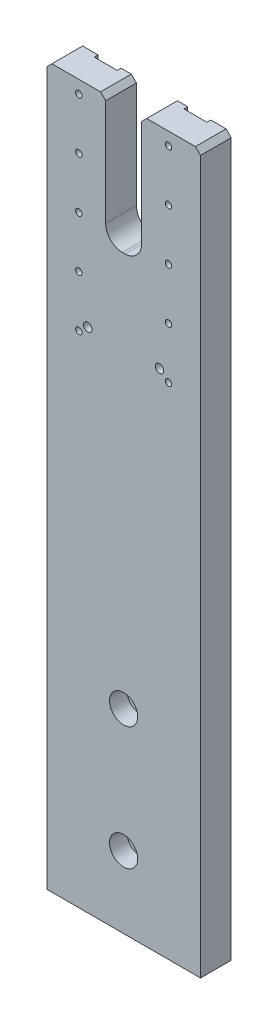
ISO-10303-21;
HEADER;
FILE_DESCRIPTION(('STEP AP214'),'2;1');
FILE_NAME('part.step','',(''),(''),'','','');
FILE_SCHEMA(('AUTOMOTIVE_DESIGN { 1 0 10303 214 1 1 1 1 }'));
ENDSEC;
DATA;
#1=APPLICATION_CONTEXT('core data for automotive mechanical design processes');
#2=APPLICATION_PROTOCOL_DEFINITION('international standard','automotive_design',2000,#1);
#3=PRODUCT_CONTEXT('',#1,'mechanical');
#4=PRODUCT('Part','Part','',(#3));
#5=PRODUCT_RELATED_PRODUCT_CATEGORY('part','',(#4));
#6=PRODUCT_DEFINITION_FORMATION('','',#4);
#7=PRODUCT_DEFINITION_CONTEXT('part definition',#1,'design');
#8=PRODUCT_DEFINITION('design','',#6,#7);
#9=PRODUCT_DEFINITION_SHAPE('','',#8);
#10=(LENGTH_UNIT() NAMED_UNIT(*) SI_UNIT(.MILLI.,.METRE.));
#11=(NAMED_UNIT(*) PLANE_ANGLE_UNIT() SI_UNIT($,.RADIAN.));
#12=(NAMED_UNIT(*) SI_UNIT($,.STERADIAN.) SOLID_ANGLE_UNIT());
#13=UNCERTAINTY_MEASURE_WITH_UNIT(LENGTH_MEASURE(1.E-05),#10,'distance_accuracy_value','');
#14=(GEOMETRIC_REPRESENTATION_CONTEXT(3) GLOBAL_UNCERTAINTY_ASSIGNED_CONTEXT((#13)) GLOBAL_UNIT_ASSIGNED_CONTEXT((#10,
#11,#12)) REPRESENTATION_CONTEXT('',''));
#15=CARTESIAN_POINT('',(0.,0.,0.));
#16=DIRECTION('',(0.,0.,1.));
#17=DIRECTION('',(1.,0.,0.));
#18=AXIS2_PLACEMENT_3D('',#15,#16,#17);
#19=CARTESIAN_POINT('',(-70.733198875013,-8.34105120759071,0.));
#20=DIRECTION('',(1.,0.,0.));
#21=DIRECTION('',(0.,0.,-1.));
#22=AXIS2_PLACEMENT_3D('',#19,#20,#21);
#23=PLANE('',#22);
#24=DIRECTION('',(0.,1.,0.));
#25=VECTOR('',#24,1.);
#26=CARTESIAN_POINT('',(-70.733198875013,-8.34105120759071,0.));
#27=LINE('',#26,#25);
#28=CARTESIAN_POINT('',(-70.733198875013,190.971389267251,0.));
#29=VERTEX_POINT('',#28);
#30=CARTESIAN_POINT('',(-70.733198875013,271.65894879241,0.));
#31=VERTEX_POINT('',#30);
#32=EDGE_CURVE('E406',#29,#31,#27,.T.);
#33=ORIENTED_EDGE('',*,*,#32,.F.);
#34=DIRECTION('',(0.,0.,1.));
#35=VECTOR('',#34,1.);
#36=CARTESIAN_POINT('',(-70.733198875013,190.971389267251,12.));
#37=LINE('',#36,#35);
#38=CARTESIAN_POINT('',(-70.733198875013,190.971389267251,1.5));
#39=VERTEX_POINT('',#38);
#40=EDGE_CURVE('E292',#29,#39,#37,.T.);
#41=ORIENTED_EDGE('',*,*,#40,.T.);
#42=DIRECTION('',(0.,1.,0.));
#43=VECTOR('',#42,1.);
#44=CARTESIAN_POINT('',(-70.733198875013,-8.34105120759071,1.5));
#45=LINE('',#44,#43);
#46=CARTESIAN_POINT('',(-70.733198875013,271.65894879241,1.5));
#47=VERTEX_POINT('',#46);
#48=EDGE_CURVE('E410',#39,#47,#45,.T.);
#49=ORIENTED_EDGE('',*,*,#48,.T.);
#50=DIRECTION('',(0.,0.,-1.));
#51=VECTOR('',#50,1.);
#52=CARTESIAN_POINT('',(-70.733198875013,271.65894879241,0.));
#53=LINE('',#52,#51);
#54=EDGE_CURVE('E388',#47,#31,#53,.T.);
#55=ORIENTED_EDGE('',*,*,#54,.T.);
#56=EDGE_LOOP('',(#33,#41,#49,#55));
#57=FACE_BOUND('',#56,.T.);
#58=ADVANCED_FACE('F16',(#57),#23,.F.);
#59=CARTESIAN_POINT('',(-44.733198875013,-8.34105120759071,0.));
#60=DIRECTION('',(-1.,0.,0.));
#61=DIRECTION('',(0.,0.,1.));
#62=AXIS2_PLACEMENT_3D('',#59,#60,#61);
#63=PLANE('',#62);
#64=DIRECTION('',(0.,1.,0.));
#65=VECTOR('',#64,1.);
#66=CARTESIAN_POINT('',(-44.733198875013,-8.34105120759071,0.));
#67=LINE('',#66,#65);
#68=CARTESIAN_POINT('',(-44.733198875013,-8.34105120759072,0.));
#69=VERTEX_POINT('',#68);
#70=CARTESIAN_POINT('',(-44.733198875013,188.346508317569,0.));
#71=VERTEX_POINT('',#70);
#72=EDGE_CURVE('E439',#69,#71,#67,.T.);
#73=ORIENTED_EDGE('',*,*,#72,.T.);
#74=DIRECTION('',(0.,0.,1.));
#75=VECTOR('',#74,1.);
#76=CARTESIAN_POINT('',(-44.733198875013,188.346508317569,12.));
#77=LINE('',#76,#75);
#78=CARTESIAN_POINT('',(-44.733198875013,188.346508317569,1.5));
#79=VERTEX_POINT('',#78);
#80=EDGE_CURVE('E478',#71,#79,#77,.T.);
#81=ORIENTED_EDGE('',*,*,#80,.T.);
#82=DIRECTION('',(0.,1.,0.));
#83=VECTOR('',#82,1.);
#84=CARTESIAN_POINT('',(-44.733198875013,-8.34105120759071,1.5));
#85=LINE('',#84,#83);
#86=CARTESIAN_POINT('',(-44.733198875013,-8.34105120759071,1.5));
#87=VERTEX_POINT('',#86);
#88=EDGE_CURVE('E435',#87,#79,#85,.T.);
#89=ORIENTED_EDGE('',*,*,#88,.F.);
#90=DIRECTION('',(0.,0.,1.));
#91=VECTOR('',#90,1.);
#92=CARTESIAN_POINT('',(-44.733198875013,-8.34105120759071,0.));
#93=LINE('',#92,#91);
#94=EDGE_CURVE('E417',#69,#87,#93,.T.);
#95=ORIENTED_EDGE('',*,*,#94,.F.);
#96=EDGE_LOOP('',(#73,#81,#89,#95));
#97=FACE_BOUND('',#96,.T.);
#98=ADVANCED_FACE('F610',(#97),#63,.F.);
#99=CARTESIAN_POINT('',(-27.733198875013,271.65894879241,12.));
#100=DIRECTION('',(0.,-1.,0.));
#101=DIRECTION('',(0.,0.,-1.));
#102=AXIS2_PLACEMENT_3D('',#99,#100,#101);
#103=PLANE('',#102);
#104=DIRECTION('',(-1.,0.,0.));
#105=VECTOR('',#104,1.);
#106=CARTESIAN_POINT('',(-27.733198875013,271.65894879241,12.));
#107=LINE('',#106,#105);
#108=CARTESIAN_POINT('',(-66.733198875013,271.65894879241,12.));
#109=VERTEX_POINT('',#108);
#110=CARTESIAN_POINT('',(-85.733198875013,271.65894879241,12.));
#111=VERTEX_POINT('',#110);
#112=EDGE_CURVE('E448',#109,#111,#107,.T.);
#113=ORIENTED_EDGE('',*,*,#112,.F.);
#114=DIRECTION('',(0.,0.,-1.));
#115=VECTOR('',#114,1.);
#116=CARTESIAN_POINT('',(-66.733198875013,271.65894879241,12.));
#117=LINE('',#116,#115);
#118=CARTESIAN_POINT('',(-66.733198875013,271.65894879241,0.));
#119=VERTEX_POINT('',#118);
#120=EDGE_CURVE('E497',#109,#119,#117,.T.);
#121=ORIENTED_EDGE('',*,*,#120,.T.);
#122=DIRECTION('',(-1.,0.,0.));
#123=VECTOR('',#122,1.);
#124=CARTESIAN_POINT('',(-27.733198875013,271.65894879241,0.));
#125=LINE('',#124,#123);
#126=EDGE_CURVE('E464',#119,#31,#125,.T.);
#127=ORIENTED_EDGE('',*,*,#126,.T.);
#128=ORIENTED_EDGE('',*,*,#54,.F.);
#129=DIRECTION('',(1.,0.,0.));
#130=VECTOR('',#129,1.);
#131=CARTESIAN_POINT('',(-79.733198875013,271.65894879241,1.5));
#132=LINE('',#131,#130);
#133=CARTESIAN_POINT('',(-79.733198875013,271.65894879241,1.5));
#134=VERTEX_POINT('',#133);
#135=EDGE_CURVE('E397',#134,#47,#132,.T.);
#136=ORIENTED_EDGE('',*,*,#135,.F.);
#137=DIRECTION('',(0.,0.,1.));
#138=VECTOR('',#137,1.);
#139=CARTESIAN_POINT('',(-79.733198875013,271.65894879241,0.));
#140=LINE('',#139,#138);
#141=CARTESIAN_POINT('',(-79.733198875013,271.65894879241,0.));
#142=VERTEX_POINT('',#141);
#143=EDGE_CURVE('E383',#142,#134,#140,.T.);
#144=ORIENTED_EDGE('',*,*,#143,.F.);
#145=CARTESIAN_POINT('',(-85.733198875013,271.65894879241,0.));
#146=VERTEX_POINT('',#145);
#147=EDGE_CURVE('E459',#142,#146,#125,.T.);
#148=ORIENTED_EDGE('',*,*,#147,.T.);
#149=DIRECTION('',(0.,0.,1.));
#150=VECTOR('',#149,1.);
#151=CARTESIAN_POINT('',(-85.733198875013,271.65894879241,12.));
#152=LINE('',#151,#150);
#153=EDGE_CURVE('E495',#146,#111,#152,.T.);
#154=ORIENTED_EDGE('',*,*,#153,.T.);
#155=EDGE_LOOP('',(#113,#121,#127,#128,#136,#144,#148,#154));
#156=FACE_BOUND('',#155,.T.);
#157=ADVANCED_FACE('F538',(#156),#103,.F.);
#158=CARTESIAN_POINT('',(0.,0.,0.));
#159=DIRECTION('',(0.,0.,1.));
#160=DIRECTION('',(1.,0.,0.));
#161=AXIS2_PLACEMENT_3D('',#158,#159,#160);
#162=PLANE('',#161);
#163=ORIENTED_EDGE('',*,*,#126,.F.);
#164=DIRECTION('',(-0.707106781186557,0.707106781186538,0.));
#165=VECTOR('',#164,1.);
#166=CARTESIAN_POINT('',(-64.733198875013,269.65894879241,0.));
#167=LINE('',#166,#165);
#168=CARTESIAN_POINT('',(-64.733198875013,269.65894879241,0.));
#169=VERTEX_POINT('',#168);
#170=EDGE_CURVE('E501',#119,#169,#167,.F.);
#171=ORIENTED_EDGE('',*,*,#170,.T.);
#172=DIRECTION('',(0.,-1.,0.));
#173=VECTOR('',#172,1.);
#174=CARTESIAN_POINT('',(-64.733198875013,271.65894879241,0.));
#175=LINE('',#174,#173);
#176=CARTESIAN_POINT('',(-64.733198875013,228.158948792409,0.));
#177=VERTEX_POINT('',#176);
#178=EDGE_CURVE('E305',#169,#177,#175,.T.);
#179=ORIENTED_EDGE('',*,*,#178,.T.);
#180=CARTESIAN_POINT('',(-58.233198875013,228.158948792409,0.));
#181=DIRECTION('',(0.,0.,1.));
#182=DIRECTION('',(1.,0.,0.));
#183=AXIS2_PLACEMENT_3D('',#180,#181,#182);
#184=CIRCLE('',#183,6.5);
#185=CARTESIAN_POINT('',(-58.233198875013,221.658948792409,0.));
#186=VERTEX_POINT('',#185);
#187=EDGE_CURVE('E307',#177,#186,#184,.T.);
#188=ORIENTED_EDGE('',*,*,#187,.T.);
#189=DIRECTION('',(1.,0.,0.));
#190=VECTOR('',#189,1.);
#191=CARTESIAN_POINT('',(-58.233198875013,221.658948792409,0.));
#192=LINE('',#191,#190);
#193=CARTESIAN_POINT('',(-57.233198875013,221.658948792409,0.));
#194=VERTEX_POINT('',#193);
#195=EDGE_CURVE('E311',#186,#194,#192,.T.);
#196=ORIENTED_EDGE('',*,*,#195,.T.);
#197=CARTESIAN_POINT('',(-57.233198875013,228.158948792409,0.));
#198=DIRECTION('',(0.,0.,1.));
#199=DIRECTION('',(1.,0.,0.));
#200=AXIS2_PLACEMENT_3D('',#197,#198,#199);
#201=CIRCLE('',#200,6.5);
#202=CARTESIAN_POINT('',(-50.733198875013,228.158948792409,0.));
#203=VERTEX_POINT('',#202);
#204=EDGE_CURVE('E314',#194,#203,#201,.T.);
#205=ORIENTED_EDGE('',*,*,#204,.T.);
#206=DIRECTION('',(0.,1.,0.));
#207=VECTOR('',#206,1.);
#208=CARTESIAN_POINT('',(-50.733198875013,271.65894879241,0.));
#209=LINE('',#208,#207);
#210=CARTESIAN_POINT('',(-50.733198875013,269.65894879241,0.));
#211=VERTEX_POINT('',#210);
#212=EDGE_CURVE('E317',#203,#211,#209,.T.);
#213=ORIENTED_EDGE('',*,*,#212,.T.);
#214=DIRECTION('',(-0.707106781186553,-0.707106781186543,0.));
#215=VECTOR('',#214,1.);
#216=CARTESIAN_POINT('',(-48.733198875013,271.65894879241,0.));
#217=LINE('',#216,#215);
#218=CARTESIAN_POINT('',(-48.733198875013,271.65894879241,0.));
#219=VERTEX_POINT('',#218);
#220=EDGE_CURVE('E499',#211,#219,#217,.F.);
#221=ORIENTED_EDGE('',*,*,#220,.T.);
#222=CARTESIAN_POINT('',(-44.733198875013,271.65894879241,0.));
#223=VERTEX_POINT('',#222);
#224=EDGE_CURVE('E463',#223,#219,#125,.T.);
#225=ORIENTED_EDGE('',*,*,#224,.F.);
#226=CARTESIAN_POINT('',(-44.733198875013,190.97138926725,0.));
#227=VERTEX_POINT('',#226);
#228=EDGE_CURVE('E442',#227,#223,#67,.T.);
#229=ORIENTED_EDGE('',*,*,#228,.F.);
#230=CARTESIAN_POINT('',(-43.7331988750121,189.658948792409,0.));
#231=DIRECTION('',(0.,0.,1.));
#232=DIRECTION('',(1.,0.,0.));
#233=AXIS2_PLACEMENT_3D('',#230,#231,#232);
#234=CIRCLE('',#233,1.65);
#235=EDGE_CURVE('E298',#227,#71,#234,.T.);
#236=ORIENTED_EDGE('',*,*,#235,.T.);
#237=ORIENTED_EDGE('',*,*,#72,.F.);
#238=DIRECTION('',(1.,0.,0.));
#239=VECTOR('',#238,1.);
#240=CARTESIAN_POINT('',(-27.733198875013,-8.34105120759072,0.));
#241=LINE('',#240,#239);
#242=CARTESIAN_POINT('',(-70.733198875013,-8.34105120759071,0.));
#243=VERTEX_POINT('',#242);
#244=EDGE_CURVE('E469',#243,#69,#241,.T.);
#245=ORIENTED_EDGE('',*,*,#244,.F.);
#246=CARTESIAN_POINT('',(-70.733198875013,188.346508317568,0.));
#247=VERTEX_POINT('',#246);
#248=EDGE_CURVE('E402',#243,#247,#27,.T.);
#249=ORIENTED_EDGE('',*,*,#248,.T.);
#250=CARTESIAN_POINT('',(-71.7331988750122,189.658948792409,0.));
#251=DIRECTION('',(0.,0.,1.));
#252=DIRECTION('',(1.,0.,0.));
#253=AXIS2_PLACEMENT_3D('',#250,#251,#252);
#254=CIRCLE('',#253,1.65);
#255=EDGE_CURVE('E286',#247,#29,#254,.T.);
#256=ORIENTED_EDGE('',*,*,#255,.T.);
#257=ORIENTED_EDGE('',*,*,#32,.T.);
#258=EDGE_LOOP('',(#163,#171,#179,#188,#196,#205,#213,#221,#225,#229,#236,#237,#245,#249,#256,#257));
#259=FACE_BOUND('',#258,.T.);
#260=CARTESIAN_POINT('',(-57.733198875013,19.6589487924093,0.));
#261=DIRECTION('',(0.,0.,1.));
#262=DIRECTION('',(1.,0.,0.));
#263=AXIS2_PLACEMENT_3D('',#260,#261,#262);
#264=CIRCLE('',#263,3.3);
#265=CARTESIAN_POINT('',(-54.433198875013,19.6589487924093,0.));
#266=VERTEX_POINT('',#265);
#267=EDGE_CURVE('E350',#266,#266,#264,.T.);
#268=ORIENTED_EDGE('',*,*,#267,.T.);
#269=EDGE_LOOP('',(#268));
#270=FACE_BOUND('',#269,.T.);
#271=CARTESIAN_POINT('',(-57.733198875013,67.6589487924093,0.));
#272=DIRECTION('',(0.,0.,1.));
#273=DIRECTION('',(1.,0.,0.));
#274=AXIS2_PLACEMENT_3D('',#271,#272,#273);
#275=CIRCLE('',#274,3.3);
#276=CARTESIAN_POINT('',(-54.433198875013,67.6589487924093,0.));
#277=VERTEX_POINT('',#276);
#278=EDGE_CURVE('E362',#277,#277,#275,.T.);
#279=ORIENTED_EDGE('',*,*,#278,.T.);
#280=EDGE_LOOP('',(#279));
#281=FACE_BOUND('',#280,.T.);
#282=ADVANCED_FACE('F583',(#259,#270,#281),#162,.F.);
#283=CARTESIAN_POINT('',(-29.7331988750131,271.65894879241,0.));
#284=VERTEX_POINT('',#283);
#285=CARTESIAN_POINT('',(-35.733198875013,271.65894879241,0.));
#286=VERTEX_POINT('',#285);
#287=EDGE_CURVE('E460',#284,#286,#125,.T.);
#288=ORIENTED_EDGE('',*,*,#287,.F.);
#289=DIRECTION('',(-0.707106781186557,0.707106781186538,0.));
#290=VECTOR('',#289,1.);
#291=CARTESIAN_POINT('',(-29.7331988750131,271.65894879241,0.));
#292=LINE('',#291,#290);
#293=CARTESIAN_POINT('',(-27.733198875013,269.65894879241,0.));
#294=VERTEX_POINT('',#293);
#295=EDGE_CURVE('E37',#284,#294,#292,.F.);
#296=ORIENTED_EDGE('',*,*,#295,.T.);
#297=DIRECTION('',(0.,1.,0.));
#298=VECTOR('',#297,1.);
#299=CARTESIAN_POINT('',(-27.733198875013,-8.34105120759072,0.));
#300=LINE('',#299,#298);
#301=CARTESIAN_POINT('',(-27.733198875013,-8.34105120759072,0.));
#302=VERTEX_POINT('',#301);
#303=EDGE_CURVE('E434',#302,#294,#300,.T.);
#304=ORIENTED_EDGE('',*,*,#303,.F.);
#305=CARTESIAN_POINT('',(-35.733198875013,-8.34105120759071,0.));
#306=VERTEX_POINT('',#305);
#307=EDGE_CURVE('E466',#306,#302,#241,.T.);
#308=ORIENTED_EDGE('',*,*,#307,.F.);
#309=DIRECTION('',(0.,1.,0.));
#310=VECTOR('',#309,1.);
#311=CARTESIAN_POINT('',(-35.733198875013,-8.34105120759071,0.));
#312=LINE('',#311,#310);
#313=EDGE_CURVE('E424',#306,#286,#312,.T.);
#314=ORIENTED_EDGE('',*,*,#313,.T.);
#315=EDGE_LOOP('',(#288,#296,#304,#308,#314));
#316=FACE_BOUND('',#315,.T.);
#317=ADVANCED_FACE('F727',(#316),#162,.F.);
#318=CARTESIAN_POINT('',(-27.733198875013,-8.34105120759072,12.));
#319=DIRECTION('',(-1.,0.,0.));
#320=DIRECTION('',(0.,-1.,0.));
#321=AXIS2_PLACEMENT_3D('',#318,#319,#320);
#322=PLANE('',#321);
#323=ORIENTED_EDGE('',*,*,#303,.T.);
#324=DIRECTION('',(0.,0.,1.));
#325=VECTOR('',#324,1.);
#326=CARTESIAN_POINT('',(-27.733198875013,269.65894879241,12.));
#327=LINE('',#326,#325);
#328=CARTESIAN_POINT('',(-27.733198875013,269.65894879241,12.));
#329=VERTEX_POINT('',#328);
#330=EDGE_CURVE('E512',#294,#329,#327,.T.);
#331=ORIENTED_EDGE('',*,*,#330,.T.);
#332=DIRECTION('',(0.,1.,0.));
#333=VECTOR('',#332,1.);
#334=CARTESIAN_POINT('',(-27.733198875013,-8.34105120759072,12.));
#335=LINE('',#334,#333);
#336=CARTESIAN_POINT('',(-27.733198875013,-8.34105120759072,12.));
#337=VERTEX_POINT('',#336);
#338=EDGE_CURVE('E445',#337,#329,#335,.T.);
#339=ORIENTED_EDGE('',*,*,#338,.F.);
#340=DIRECTION('',(0.,0.,-1.));
#341=VECTOR('',#340,1.);
#342=CARTESIAN_POINT('',(-27.733198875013,-8.34105120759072,12.));
#343=LINE('',#342,#341);
#344=EDGE_CURVE('E457',#337,#302,#343,.T.);
#345=ORIENTED_EDGE('',*,*,#344,.T.);
#346=EDGE_LOOP('',(#323,#331,#339,#345));
#347=FACE_BOUND('',#346,.T.);
#348=ADVANCED_FACE('F724',(#347),#322,.F.);
#349=ORIENTED_EDGE('',*,*,#224,.T.);
#350=DIRECTION('',(0.,0.,1.));
#351=VECTOR('',#350,1.);
#352=CARTESIAN_POINT('',(-48.733198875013,271.65894879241,12.));
#353=LINE('',#352,#351);
#354=CARTESIAN_POINT('',(-48.733198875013,271.65894879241,12.));
#355=VERTEX_POINT('',#354);
#356=EDGE_CURVE('E506',#219,#355,#353,.T.);
#357=ORIENTED_EDGE('',*,*,#356,.T.);
#358=CARTESIAN_POINT('',(-29.7331988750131,271.65894879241,12.));
#359=VERTEX_POINT('',#358);
#360=EDGE_CURVE('E450',#359,#355,#107,.T.);
#361=ORIENTED_EDGE('',*,*,#360,.F.);
#362=DIRECTION('',(0.,0.,-1.));
#363=VECTOR('',#362,1.);
#364=CARTESIAN_POINT('',(-29.7331988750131,271.65894879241,12.));
#365=LINE('',#364,#363);
#366=EDGE_CURVE('E503',#359,#284,#365,.T.);
#367=ORIENTED_EDGE('',*,*,#366,.T.);
#368=ORIENTED_EDGE('',*,*,#287,.T.);
#369=DIRECTION('',(0.,0.,-1.));
#370=VECTOR('',#369,1.);
#371=CARTESIAN_POINT('',(-35.733198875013,271.65894879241,0.));
#372=LINE('',#371,#370);
#373=CARTESIAN_POINT('',(-35.733198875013,271.65894879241,1.5));
#374=VERTEX_POINT('',#373);
#375=EDGE_CURVE('E405',#374,#286,#372,.T.);
#376=ORIENTED_EDGE('',*,*,#375,.F.);
#377=DIRECTION('',(1.,0.,0.));
#378=VECTOR('',#377,1.);
#379=CARTESIAN_POINT('',(-35.733198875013,271.65894879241,1.5));
#380=LINE('',#379,#378);
#381=CARTESIAN_POINT('',(-44.733198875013,271.65894879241,1.5));
#382=VERTEX_POINT('',#381);
#383=EDGE_CURVE('E418',#382,#374,#380,.T.);
#384=ORIENTED_EDGE('',*,*,#383,.F.);
#385=DIRECTION('',(0.,0.,1.));
#386=VECTOR('',#385,1.);
#387=CARTESIAN_POINT('',(-44.733198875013,271.65894879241,0.));
#388=LINE('',#387,#386);
#389=EDGE_CURVE('E427',#223,#382,#388,.T.);
#390=ORIENTED_EDGE('',*,*,#389,.F.);
#391=EDGE_LOOP('',(#349,#357,#361,#367,#368,#376,#384,#390));
#392=FACE_BOUND('',#391,.T.);
#393=ADVANCED_FACE('F547',(#392),#103,.F.);
#394=CARTESIAN_POINT('',(-87.733198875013,-8.34105120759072,12.));
#395=DIRECTION('',(1.,0.,0.));
#396=DIRECTION('',(0.,0.,-1.));
#397=AXIS2_PLACEMENT_3D('',#394,#395,#396);
#398=PLANE('',#397);
#399=CARTESIAN_POINT('',(-87.733198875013,166.658948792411,3.));
#400=DIRECTION('',(-1.,0.,0.));
#401=DIRECTION('',(0.,0.,1.));
#402=AXIS2_PLACEMENT_3D('',#399,#400,#401);
#403=CIRCLE('',#402,1.25);
#404=CARTESIAN_POINT('',(-87.733198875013,166.658948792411,4.25));
#405=VERTEX_POINT('',#404);
#406=EDGE_CURVE('E213',#405,#405,#403,.T.);
#407=ORIENTED_EDGE('',*,*,#406,.F.);
#408=EDGE_LOOP('',(#407));
#409=FACE_BOUND('',#408,.T.);
#410=CARTESIAN_POINT('',(-87.733198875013,166.658948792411,9.));
#411=DIRECTION('',(-1.,0.,0.));
#412=DIRECTION('',(0.,0.,1.));
#413=AXIS2_PLACEMENT_3D('',#410,#411,#412);
#414=CIRCLE('',#413,1.25);
#415=CARTESIAN_POINT('',(-87.733198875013,166.658948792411,10.25));
#416=VERTEX_POINT('',#415);
#417=EDGE_CURVE('E212',#416,#416,#414,.T.);
#418=ORIENTED_EDGE('',*,*,#417,.F.);
#419=EDGE_LOOP('',(#418));
#420=FACE_BOUND('',#419,.T.);
#421=DIRECTION('',(0.,-1.,0.));
#422=VECTOR('',#421,1.);
#423=CARTESIAN_POINT('',(-87.733198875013,-8.34105120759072,12.));
#424=LINE('',#423,#422);
#425=CARTESIAN_POINT('',(-87.733198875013,269.65894879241,12.));
#426=VERTEX_POINT('',#425);
#427=CARTESIAN_POINT('',(-87.733198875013,-8.34105120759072,12.));
#428=VERTEX_POINT('',#427);
#429=EDGE_CURVE('E453',#426,#428,#424,.T.);
#430=ORIENTED_EDGE('',*,*,#429,.F.);
#431=DIRECTION('',(0.,0.,-1.));
#432=VECTOR('',#431,1.);
#433=CARTESIAN_POINT('',(-87.733198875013,269.65894879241,12.));
#434=LINE('',#433,#432);
#435=CARTESIAN_POINT('',(-87.733198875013,269.65894879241,0.));
#436=VERTEX_POINT('',#435);
#437=EDGE_CURVE('E24',#426,#436,#434,.T.);
#438=ORIENTED_EDGE('',*,*,#437,.T.);
#439=DIRECTION('',(0.,-1.,0.));
#440=VECTOR('',#439,1.);
#441=CARTESIAN_POINT('',(-87.733198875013,-8.34105120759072,0.));
#442=LINE('',#441,#440);
#443=CARTESIAN_POINT('',(-87.733198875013,-8.34105120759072,0.));
#444=VERTEX_POINT('',#443);
#445=EDGE_CURVE('E462',#436,#444,#442,.T.);
#446=ORIENTED_EDGE('',*,*,#445,.T.);
#447=DIRECTION('',(0.,0.,-1.));
#448=VECTOR('',#447,1.);
#449=CARTESIAN_POINT('',(-87.733198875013,-8.34105120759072,12.));
#450=LINE('',#449,#448);
#451=EDGE_CURVE('E472',#428,#444,#450,.T.);
#452=ORIENTED_EDGE('',*,*,#451,.F.);
#453=EDGE_LOOP('',(#430,#438,#446,#452));
#454=FACE_BOUND('',#453,.T.);
#455=ADVANCED_FACE('F516',(#409,#420,#454),#398,.F.);
#456=CARTESIAN_POINT('',(-27.733198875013,-8.34105120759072,12.));
#457=DIRECTION('',(0.,1.,0.));
#458=DIRECTION('',(0.,0.,1.));
#459=AXIS2_PLACEMENT_3D('',#456,#457,#458);
#460=PLANE('',#459);
#461=CARTESIAN_POINT('',(-35.733198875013,-8.34105120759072,6.));
#462=DIRECTION('',(0.,-1.,0.));
#463=DIRECTION('',(0.,0.,-1.));
#464=AXIS2_PLACEMENT_3D('',#461,#462,#463);
#465=CIRCLE('',#464,2.5);
#466=CARTESIAN_POINT('',(-35.733198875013,-8.34105120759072,3.5));
#467=VERTEX_POINT('',#466);
#468=EDGE_CURVE('E365',#467,#467,#465,.T.);
#469=ORIENTED_EDGE('',*,*,#468,.F.);
#470=EDGE_LOOP('',(#469));
#471=FACE_BOUND('',#470,.T.);
#472=CARTESIAN_POINT('',(-57.733198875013,-8.34105120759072,6.));
#473=DIRECTION('',(0.,-1.,0.));
#474=DIRECTION('',(0.,0.,-1.));
#475=AXIS2_PLACEMENT_3D('',#472,#473,#474);
#476=CIRCLE('',#475,2.5);
#477=CARTESIAN_POINT('',(-57.733198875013,-8.34105120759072,3.5));
#478=VERTEX_POINT('',#477);
#479=EDGE_CURVE('E371',#478,#478,#476,.T.);
#480=ORIENTED_EDGE('',*,*,#479,.F.);
#481=EDGE_LOOP('',(#480));
#482=FACE_BOUND('',#481,.T.);
#483=CARTESIAN_POINT('',(-79.733198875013,-8.34105120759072,6.));
#484=DIRECTION('',(0.,-1.,0.));
#485=DIRECTION('',(0.,0.,-1.));
#486=AXIS2_PLACEMENT_3D('',#483,#484,#485);
#487=CIRCLE('',#486,2.5);
#488=CARTESIAN_POINT('',(-79.733198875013,-8.34105120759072,3.5));
#489=VERTEX_POINT('',#488);
#490=EDGE_CURVE('E377',#489,#489,#487,.T.);
#491=ORIENTED_EDGE('',*,*,#490,.F.);
#492=EDGE_LOOP('',(#491));
#493=FACE_BOUND('',#492,.T.);
#494=DIRECTION('',(1.,0.,0.));
#495=VECTOR('',#494,1.);
#496=CARTESIAN_POINT('',(-79.733198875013,-8.34105120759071,1.5));
#497=LINE('',#496,#495);
#498=CARTESIAN_POINT('',(-79.733198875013,-8.34105120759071,1.5));
#499=VERTEX_POINT('',#498);
#500=CARTESIAN_POINT('',(-70.733198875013,-8.34105120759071,1.5));
#501=VERTEX_POINT('',#500);
#502=EDGE_CURVE('E387',#499,#501,#497,.T.);
#503=ORIENTED_EDGE('',*,*,#502,.T.);
#504=DIRECTION('',(0.,0.,-1.));
#505=VECTOR('',#504,1.);
#506=CARTESIAN_POINT('',(-70.733198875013,-8.34105120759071,0.));
#507=LINE('',#506,#505);
#508=EDGE_CURVE('E391',#501,#243,#507,.T.);
#509=ORIENTED_EDGE('',*,*,#508,.T.);
#510=ORIENTED_EDGE('',*,*,#244,.T.);
#511=ORIENTED_EDGE('',*,*,#94,.T.);
#512=DIRECTION('',(1.,0.,0.));
#513=VECTOR('',#512,1.);
#514=CARTESIAN_POINT('',(-35.733198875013,-8.34105120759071,1.5));
#515=LINE('',#514,#513);
#516=CARTESIAN_POINT('',(-35.733198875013,-8.34105120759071,1.5));
#517=VERTEX_POINT('',#516);
#518=EDGE_CURVE('E421',#87,#517,#515,.T.);
#519=ORIENTED_EDGE('',*,*,#518,.T.);
#520=DIRECTION('',(0.,0.,-1.));
#521=VECTOR('',#520,1.);
#522=CARTESIAN_POINT('',(-35.733198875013,-8.34105120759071,0.));
#523=LINE('',#522,#521);
#524=EDGE_CURVE('E414',#517,#306,#523,.T.);
#525=ORIENTED_EDGE('',*,*,#524,.T.);
#526=ORIENTED_EDGE('',*,*,#307,.T.);
#527=ORIENTED_EDGE('',*,*,#344,.F.);
#528=DIRECTION('',(1.,0.,0.));
#529=VECTOR('',#528,1.);
#530=CARTESIAN_POINT('',(-27.733198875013,-8.34105120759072,12.));
#531=LINE('',#530,#529);
#532=EDGE_CURVE('E455',#428,#337,#531,.T.);
#533=ORIENTED_EDGE('',*,*,#532,.F.);
#534=ORIENTED_EDGE('',*,*,#451,.T.);
#535=CARTESIAN_POINT('',(-79.733198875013,-8.34105120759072,0.));
#536=VERTEX_POINT('',#535);
#537=EDGE_CURVE('E449',#444,#536,#241,.T.);
#538=ORIENTED_EDGE('',*,*,#537,.T.);
#539=DIRECTION('',(0.,0.,1.));
#540=VECTOR('',#539,1.);
#541=CARTESIAN_POINT('',(-79.733198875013,-8.34105120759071,0.));
#542=LINE('',#541,#540);
#543=EDGE_CURVE('E384',#536,#499,#542,.T.);
#544=ORIENTED_EDGE('',*,*,#543,.T.);
#545=EDGE_LOOP('',(#503,#509,#510,#511,#519,#525,#526,#527,#533,#534,#538,#544));
#546=FACE_BOUND('',#545,.T.);
#547=ADVANCED_FACE('F526',(#471,#482,#493,#546),#460,.F.);
#548=CARTESIAN_POINT('',(0.,0.,12.));
#549=DIRECTION('',(0.,0.,1.));
#550=DIRECTION('',(1.,0.,0.));
#551=AXIS2_PLACEMENT_3D('',#548,#549,#550);
#552=PLANE('',#551);
#553=CARTESIAN_POINT('',(-75.2331988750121,266.65894879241,12.));
#554=DIRECTION('',(0.,0.,-1.));
#555=DIRECTION('',(-1.,0.,0.));
#556=AXIS2_PLACEMENT_3D('',#553,#554,#555);
#557=CIRCLE('',#556,1.25);
#558=CARTESIAN_POINT('',(-76.4831988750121,266.65894879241,12.));
#559=VERTEX_POINT('',#558);
#560=EDGE_CURVE('E226',#559,#559,#557,.T.);
#561=ORIENTED_EDGE('',*,*,#560,.T.);
#562=EDGE_LOOP('',(#561));
#563=FACE_BOUND('',#562,.T.);
#564=CARTESIAN_POINT('',(-75.2331988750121,246.658948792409,12.));
#565=DIRECTION('',(0.,0.,-1.));
#566=DIRECTION('',(-1.,0.,0.));
#567=AXIS2_PLACEMENT_3D('',#564,#565,#566);
#568=CIRCLE('',#567,1.25);
#569=CARTESIAN_POINT('',(-76.4831988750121,246.658948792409,12.));
#570=VERTEX_POINT('',#569);
#571=EDGE_CURVE('E232',#570,#570,#568,.T.);
#572=ORIENTED_EDGE('',*,*,#571,.T.);
#573=EDGE_LOOP('',(#572));
#574=FACE_BOUND('',#573,.T.);
#575=CARTESIAN_POINT('',(-75.2331988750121,226.658948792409,12.));
#576=DIRECTION('',(0.,0.,-1.));
#577=DIRECTION('',(-1.,0.,0.));
#578=AXIS2_PLACEMENT_3D('',#575,#576,#577);
#579=CIRCLE('',#578,1.25);
#580=CARTESIAN_POINT('',(-76.4831988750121,226.658948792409,12.));
#581=VERTEX_POINT('',#580);
#582=EDGE_CURVE('E238',#581,#581,#579,.T.);
#583=ORIENTED_EDGE('',*,*,#582,.T.);
#584=EDGE_LOOP('',(#583));
#585=FACE_BOUND('',#584,.T.);
#586=CARTESIAN_POINT('',(-75.2331988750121,206.65894879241,12.));
#587=DIRECTION('',(0.,0.,-1.));
#588=DIRECTION('',(-1.,0.,0.));
#589=AXIS2_PLACEMENT_3D('',#586,#587,#588);
#590=CIRCLE('',#589,1.25);
#591=CARTESIAN_POINT('',(-76.4831988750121,206.65894879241,12.));
#592=VERTEX_POINT('',#591);
#593=EDGE_CURVE('E244',#592,#592,#590,.T.);
#594=ORIENTED_EDGE('',*,*,#593,.T.);
#595=EDGE_LOOP('',(#594));
#596=FACE_BOUND('',#595,.T.);
#597=CARTESIAN_POINT('',(-75.2331988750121,186.658948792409,12.));
#598=DIRECTION('',(0.,0.,-1.));
#599=DIRECTION('',(-1.,0.,0.));
#600=AXIS2_PLACEMENT_3D('',#597,#598,#599);
#601=CIRCLE('',#600,1.25);
#602=CARTESIAN_POINT('',(-76.4831988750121,186.658948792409,12.));
#603=VERTEX_POINT('',#602);
#604=EDGE_CURVE('E250',#603,#603,#601,.T.);
#605=ORIENTED_EDGE('',*,*,#604,.T.);
#606=EDGE_LOOP('',(#605));
#607=FACE_BOUND('',#606,.T.);
#608=CARTESIAN_POINT('',(-40.2331988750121,186.658948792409,12.));
#609=DIRECTION('',(0.,0.,-1.));
#610=DIRECTION('',(-1.,0.,0.));
#611=AXIS2_PLACEMENT_3D('',#608,#609,#610);
#612=CIRCLE('',#611,1.25);
#613=CARTESIAN_POINT('',(-41.4831988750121,186.658948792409,12.));
#614=VERTEX_POINT('',#613);
#615=EDGE_CURVE('E256',#614,#614,#612,.T.);
#616=ORIENTED_EDGE('',*,*,#615,.T.);
#617=EDGE_LOOP('',(#616));
#618=FACE_BOUND('',#617,.T.);
#619=CARTESIAN_POINT('',(-40.2331988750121,206.65894879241,12.));
#620=DIRECTION('',(0.,0.,-1.));
#621=DIRECTION('',(-1.,0.,0.));
#622=AXIS2_PLACEMENT_3D('',#619,#620,#621);
#623=CIRCLE('',#622,1.25);
#624=CARTESIAN_POINT('',(-41.4831988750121,206.65894879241,12.));
#625=VERTEX_POINT('',#624);
#626=EDGE_CURVE('E262',#625,#625,#623,.T.);
#627=ORIENTED_EDGE('',*,*,#626,.T.);
#628=EDGE_LOOP('',(#627));
#629=FACE_BOUND('',#628,.T.);
#630=CARTESIAN_POINT('',(-40.2331988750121,226.658948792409,12.));
#631=DIRECTION('',(0.,0.,-1.));
#632=DIRECTION('',(-1.,0.,0.));
#633=AXIS2_PLACEMENT_3D('',#630,#631,#632);
#634=CIRCLE('',#633,1.25);
#635=CARTESIAN_POINT('',(-41.4831988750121,226.658948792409,12.));
#636=VERTEX_POINT('',#635);
#637=EDGE_CURVE('E268',#636,#636,#634,.T.);
#638=ORIENTED_EDGE('',*,*,#637,.T.);
#639=EDGE_LOOP('',(#638));
#640=FACE_BOUND('',#639,.T.);
#641=CARTESIAN_POINT('',(-40.2331988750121,246.658948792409,12.));
#642=DIRECTION('',(0.,0.,-1.));
#643=DIRECTION('',(-1.,0.,0.));
#644=AXIS2_PLACEMENT_3D('',#641,#642,#643);
#645=CIRCLE('',#644,1.25);
#646=CARTESIAN_POINT('',(-41.4831988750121,246.658948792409,12.));
#647=VERTEX_POINT('',#646);
#648=EDGE_CURVE('E274',#647,#647,#645,.T.);
#649=ORIENTED_EDGE('',*,*,#648,.T.);
#650=EDGE_LOOP('',(#649));
#651=FACE_BOUND('',#650,.T.);
#652=CARTESIAN_POINT('',(-40.2331988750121,266.65894879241,12.));
#653=DIRECTION('',(0.,0.,-1.));
#654=DIRECTION('',(-1.,0.,0.));
#655=AXIS2_PLACEMENT_3D('',#652,#653,#654);
#656=CIRCLE('',#655,1.25);
#657=CARTESIAN_POINT('',(-41.4831988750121,266.65894879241,12.));
#658=VERTEX_POINT('',#657);
#659=EDGE_CURVE('E280',#658,#658,#656,.T.);
#660=ORIENTED_EDGE('',*,*,#659,.T.);
#661=EDGE_LOOP('',(#660));
#662=FACE_BOUND('',#661,.T.);
#663=CARTESIAN_POINT('',(-71.7331988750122,189.658948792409,12.));
#664=DIRECTION('',(0.,0.,1.));
#665=DIRECTION('',(1.,0.,0.));
#666=AXIS2_PLACEMENT_3D('',#663,#664,#665);
#667=CIRCLE('',#666,1.65);
#668=CARTESIAN_POINT('',(-70.0831988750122,189.658948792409,12.));
#669=VERTEX_POINT('',#668);
#670=EDGE_CURVE('E283',#669,#669,#667,.T.);
#671=ORIENTED_EDGE('',*,*,#670,.F.);
#672=EDGE_LOOP('',(#671));
#673=FACE_BOUND('',#672,.T.);
#674=CARTESIAN_POINT('',(-43.7331988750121,189.658948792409,12.));
#675=DIRECTION('',(0.,0.,1.));
#676=DIRECTION('',(1.,0.,0.));
#677=AXIS2_PLACEMENT_3D('',#674,#675,#676);
#678=CIRCLE('',#677,1.65);
#679=CARTESIAN_POINT('',(-42.0831988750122,189.658948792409,12.));
#680=VERTEX_POINT('',#679);
#681=EDGE_CURVE('E295',#680,#680,#678,.T.);
#682=ORIENTED_EDGE('',*,*,#681,.F.);
#683=EDGE_LOOP('',(#682));
#684=FACE_BOUND('',#683,.T.);
#685=DIRECTION('',(0.,-1.,0.));
#686=VECTOR('',#685,1.);
#687=CARTESIAN_POINT('',(-64.733198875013,271.65894879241,12.));
#688=LINE('',#687,#686);
#689=CARTESIAN_POINT('',(-64.733198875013,269.65894879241,12.));
#690=VERTEX_POINT('',#689);
#691=CARTESIAN_POINT('',(-64.733198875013,228.158948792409,12.));
#692=VERTEX_POINT('',#691);
#693=EDGE_CURVE('E304',#690,#692,#688,.T.);
#694=ORIENTED_EDGE('',*,*,#693,.F.);
#695=DIRECTION('',(0.707106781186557,-0.707106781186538,0.));
#696=VECTOR('',#695,1.);
#697=CARTESIAN_POINT('',(102.462874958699,102.462874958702,12.));
#698=LINE('',#697,#696);
#699=EDGE_CURVE('E493',#690,#109,#698,.F.);
#700=ORIENTED_EDGE('',*,*,#699,.T.);
#701=ORIENTED_EDGE('',*,*,#112,.T.);
#702=DIRECTION('',(0.707106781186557,0.707106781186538,0.));
#703=VECTOR('',#702,1.);
#704=CARTESIAN_POINT('',(-178.69607383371,178.696073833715,12.));
#705=LINE('',#704,#703);
#706=EDGE_CURVE('E487',#111,#426,#705,.F.);
#707=ORIENTED_EDGE('',*,*,#706,.T.);
#708=ORIENTED_EDGE('',*,*,#429,.T.);
#709=ORIENTED_EDGE('',*,*,#532,.T.);
#710=ORIENTED_EDGE('',*,*,#338,.T.);
#711=DIRECTION('',(0.707106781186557,-0.707106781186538,0.));
#712=VECTOR('',#711,1.);
#713=CARTESIAN_POINT('',(120.962874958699,120.962874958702,12.));
#714=LINE('',#713,#712);
#715=EDGE_CURVE('E489',#329,#359,#714,.F.);
#716=ORIENTED_EDGE('',*,*,#715,.T.);
#717=ORIENTED_EDGE('',*,*,#360,.T.);
#718=DIRECTION('',(0.707106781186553,0.707106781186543,0.));
#719=VECTOR('',#718,1.);
#720=CARTESIAN_POINT('',(-160.196073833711,160.196073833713,12.));
#721=LINE('',#720,#719);
#722=CARTESIAN_POINT('',(-50.733198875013,269.65894879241,12.));
#723=VERTEX_POINT('',#722);
#724=EDGE_CURVE('E491',#355,#723,#721,.F.);
#725=ORIENTED_EDGE('',*,*,#724,.T.);
#726=DIRECTION('',(0.,1.,0.));
#727=VECTOR('',#726,1.);
#728=CARTESIAN_POINT('',(-50.733198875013,271.65894879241,12.));
#729=LINE('',#728,#727);
#730=CARTESIAN_POINT('',(-50.733198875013,228.158948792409,12.));
#731=VERTEX_POINT('',#730);
#732=EDGE_CURVE('E308',#731,#723,#729,.T.);
#733=ORIENTED_EDGE('',*,*,#732,.F.);
#734=CARTESIAN_POINT('',(-57.233198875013,228.158948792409,12.));
#735=DIRECTION('',(0.,0.,1.));
#736=DIRECTION('',(1.,0.,0.));
#737=AXIS2_PLACEMENT_3D('',#734,#735,#736);
#738=CIRCLE('',#737,6.5);
#739=CARTESIAN_POINT('',(-57.233198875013,221.658948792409,12.));
#740=VERTEX_POINT('',#739);
#741=EDGE_CURVE('E328',#740,#731,#738,.T.);
#742=ORIENTED_EDGE('',*,*,#741,.F.);
#743=DIRECTION('',(1.,0.,0.));
#744=VECTOR('',#743,1.);
#745=CARTESIAN_POINT('',(-58.233198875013,221.658948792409,12.));
#746=LINE('',#745,#744);
#747=CARTESIAN_POINT('',(-58.233198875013,221.658948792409,12.));
#748=VERTEX_POINT('',#747);
#749=EDGE_CURVE('E325',#748,#740,#746,.T.);
#750=ORIENTED_EDGE('',*,*,#749,.F.);
#751=CARTESIAN_POINT('',(-58.233198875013,228.158948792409,12.));
#752=DIRECTION('',(0.,0.,1.));
#753=DIRECTION('',(1.,0.,0.));
#754=AXIS2_PLACEMENT_3D('',#751,#752,#753);
#755=CIRCLE('',#754,6.5);
#756=EDGE_CURVE('E322',#692,#748,#755,.T.);
#757=ORIENTED_EDGE('',*,*,#756,.F.);
#758=EDGE_LOOP('',(#694,#700,#701,#707,#708,#709,#710,#716,#717,#725,#733,#742,#750,#757));
#759=FACE_BOUND('',#758,.T.);
#760=CARTESIAN_POINT('',(-57.733198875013,19.6589487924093,12.));
#761=DIRECTION('',(0.,0.,1.));
#762=DIRECTION('',(1.,0.,0.));
#763=AXIS2_PLACEMENT_3D('',#760,#761,#762);
#764=CIRCLE('',#763,5.5);
#765=CARTESIAN_POINT('',(-52.233198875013,19.6589487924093,12.));
#766=VERTEX_POINT('',#765);
#767=EDGE_CURVE('E335',#766,#766,#764,.T.);
#768=ORIENTED_EDGE('',*,*,#767,.F.);
#769=EDGE_LOOP('',(#768));
#770=FACE_BOUND('',#769,.T.);
#771=CARTESIAN_POINT('',(-57.733198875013,67.6589487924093,12.));
#772=DIRECTION('',(0.,0.,1.));
#773=DIRECTION('',(1.,0.,0.));
#774=AXIS2_PLACEMENT_3D('',#771,#772,#773);
#775=CIRCLE('',#774,5.5);
#776=CARTESIAN_POINT('',(-52.233198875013,67.6589487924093,12.));
#777=VERTEX_POINT('',#776);
#778=EDGE_CURVE('E353',#777,#777,#775,.T.);
#779=ORIENTED_EDGE('',*,*,#778,.F.);
#780=EDGE_LOOP('',(#779));
#781=FACE_BOUND('',#780,.T.);
#782=ADVANCED_FACE('F532',(#563,#574,#585,#596,#607,#618,#629,#640,#651,#662,#673,#684,#759,
#770,#781),#552,.T.);
#783=ORIENTED_EDGE('',*,*,#445,.F.);
#784=DIRECTION('',(-0.707106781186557,-0.707106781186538,0.));
#785=VECTOR('',#784,1.);
#786=CARTESIAN_POINT('',(-87.733198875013,269.65894879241,0.));
#787=LINE('',#786,#785);
#788=EDGE_CURVE('E11',#436,#146,#787,.F.);
#789=ORIENTED_EDGE('',*,*,#788,.T.);
#790=ORIENTED_EDGE('',*,*,#147,.F.);
#791=DIRECTION('',(0.,1.,0.));
#792=VECTOR('',#791,1.);
#793=CARTESIAN_POINT('',(-79.733198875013,-8.34105120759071,0.));
#794=LINE('',#793,#792);
#795=EDGE_CURVE('E394',#536,#142,#794,.T.);
#796=ORIENTED_EDGE('',*,*,#795,.F.);
#797=ORIENTED_EDGE('',*,*,#537,.F.);
#798=EDGE_LOOP('',(#783,#789,#790,#796,#797));
#799=FACE_BOUND('',#798,.T.);
#800=ADVANCED_FACE('F521',(#799),#162,.F.);
#801=CARTESIAN_POINT('',(-35.733198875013,-8.34105120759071,0.));
#802=DIRECTION('',(1.,0.,0.));
#803=DIRECTION('',(0.,0.,-1.));
#804=AXIS2_PLACEMENT_3D('',#801,#802,#803);
#805=PLANE('',#804);
#806=ORIENTED_EDGE('',*,*,#375,.T.);
#807=ORIENTED_EDGE('',*,*,#313,.F.);
#808=ORIENTED_EDGE('',*,*,#524,.F.);
#809=DIRECTION('',(0.,1.,0.));
#810=VECTOR('',#809,1.);
#811=CARTESIAN_POINT('',(-35.733198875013,-8.34105120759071,1.5));
#812=LINE('',#811,#810);
#813=EDGE_CURVE('E432',#517,#374,#812,.T.);
#814=ORIENTED_EDGE('',*,*,#813,.T.);
#815=EDGE_LOOP('',(#806,#807,#808,#814));
#816=FACE_BOUND('',#815,.T.);
#817=ADVANCED_FACE('F745',(#816),#805,.F.);
#818=CARTESIAN_POINT('',(-35.733198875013,-8.34105120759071,1.5));
#819=DIRECTION('',(0.,0.,1.));
#820=DIRECTION('',(1.,0.,0.));
#821=AXIS2_PLACEMENT_3D('',#818,#819,#820);
#822=PLANE('',#821);
#823=CARTESIAN_POINT('',(-40.2331988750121,186.658948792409,1.5));
#824=DIRECTION('',(0.,0.,-1.));
#825=DIRECTION('',(-1.,0.,0.));
#826=AXIS2_PLACEMENT_3D('',#823,#824,#825);
#827=CIRCLE('',#826,1.25);
#828=CARTESIAN_POINT('',(-41.4831988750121,186.658948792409,1.5));
#829=VERTEX_POINT('',#828);
#830=EDGE_CURVE('E253',#829,#829,#827,.T.);
#831=ORIENTED_EDGE('',*,*,#830,.F.);
#832=EDGE_LOOP('',(#831));
#833=FACE_BOUND('',#832,.T.);
#834=CARTESIAN_POINT('',(-40.2331988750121,206.65894879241,1.5));
#835=DIRECTION('',(0.,0.,-1.));
#836=DIRECTION('',(-1.,0.,0.));
#837=AXIS2_PLACEMENT_3D('',#834,#835,#836);
#838=CIRCLE('',#837,1.25);
#839=CARTESIAN_POINT('',(-41.4831988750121,206.65894879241,1.5));
#840=VERTEX_POINT('',#839);
#841=EDGE_CURVE('E259',#840,#840,#838,.T.);
#842=ORIENTED_EDGE('',*,*,#841,.F.);
#843=EDGE_LOOP('',(#842));
#844=FACE_BOUND('',#843,.T.);
#845=CARTESIAN_POINT('',(-40.2331988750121,226.658948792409,1.5));
#846=DIRECTION('',(0.,0.,-1.));
#847=DIRECTION('',(-1.,0.,0.));
#848=AXIS2_PLACEMENT_3D('',#845,#846,#847);
#849=CIRCLE('',#848,1.25);
#850=CARTESIAN_POINT('',(-41.4831988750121,226.658948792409,1.5));
#851=VERTEX_POINT('',#850);
#852=EDGE_CURVE('E265',#851,#851,#849,.T.);
#853=ORIENTED_EDGE('',*,*,#852,.F.);
#854=EDGE_LOOP('',(#853));
#855=FACE_BOUND('',#854,.T.);
#856=CARTESIAN_POINT('',(-40.2331988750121,246.658948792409,1.5));
#857=DIRECTION('',(0.,0.,-1.));
#858=DIRECTION('',(-1.,0.,0.));
#859=AXIS2_PLACEMENT_3D('',#856,#857,#858);
#860=CIRCLE('',#859,1.25);
#861=CARTESIAN_POINT('',(-41.4831988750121,246.658948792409,1.5));
#862=VERTEX_POINT('',#861);
#863=EDGE_CURVE('E271',#862,#862,#860,.T.);
#864=ORIENTED_EDGE('',*,*,#863,.F.);
#865=EDGE_LOOP('',(#864));
#866=FACE_BOUND('',#865,.T.);
#867=CARTESIAN_POINT('',(-40.2331988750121,266.65894879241,1.5));
#868=DIRECTION('',(0.,0.,-1.));
#869=DIRECTION('',(-1.,0.,0.));
#870=AXIS2_PLACEMENT_3D('',#867,#868,#869);
#871=CIRCLE('',#870,1.25);
#872=CARTESIAN_POINT('',(-41.4831988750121,266.65894879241,1.5));
#873=VERTEX_POINT('',#872);
#874=EDGE_CURVE('E277',#873,#873,#871,.T.);
#875=ORIENTED_EDGE('',*,*,#874,.F.);
#876=EDGE_LOOP('',(#875));
#877=FACE_BOUND('',#876,.T.);
#878=ORIENTED_EDGE('',*,*,#88,.T.);
#879=CARTESIAN_POINT('',(-43.7331988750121,189.658948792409,1.5));
#880=DIRECTION('',(0.,0.,1.));
#881=DIRECTION('',(1.,0.,0.));
#882=AXIS2_PLACEMENT_3D('',#879,#880,#881);
#883=CIRCLE('',#882,1.65);
#884=CARTESIAN_POINT('',(-44.733198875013,190.97138926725,1.5));
#885=VERTEX_POINT('',#884);
#886=EDGE_CURVE('E301',#79,#885,#883,.T.);
#887=ORIENTED_EDGE('',*,*,#886,.T.);
#888=EDGE_CURVE('E438',#885,#382,#85,.T.);
#889=ORIENTED_EDGE('',*,*,#888,.T.);
#890=ORIENTED_EDGE('',*,*,#383,.T.);
#891=ORIENTED_EDGE('',*,*,#813,.F.);
#892=ORIENTED_EDGE('',*,*,#518,.F.);
#893=EDGE_LOOP('',(#878,#887,#889,#890,#891,#892));
#894=FACE_BOUND('',#893,.T.);
#895=ADVANCED_FACE('F625',(#833,#844,#855,#866,#877,#894),#822,.F.);
#896=ORIENTED_EDGE('',*,*,#888,.F.);
#897=DIRECTION('',(0.,0.,1.));
#898=VECTOR('',#897,1.);
#899=CARTESIAN_POINT('',(-44.733198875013,190.97138926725,12.));
#900=LINE('',#899,#898);
#901=EDGE_CURVE('E475',#885,#227,#900,.F.);
#902=ORIENTED_EDGE('',*,*,#901,.T.);
#903=ORIENTED_EDGE('',*,*,#228,.T.);
#904=ORIENTED_EDGE('',*,*,#389,.T.);
#905=EDGE_LOOP('',(#896,#902,#903,#904));
#906=FACE_BOUND('',#905,.T.);
#907=ADVANCED_FACE('F618',(#906),#63,.F.);
#908=CARTESIAN_POINT('',(-70.733198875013,188.346508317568,1.5));
#909=VERTEX_POINT('',#908);
#910=EDGE_CURVE('E407',#501,#909,#45,.T.);
#911=ORIENTED_EDGE('',*,*,#910,.T.);
#912=DIRECTION('',(0.,0.,1.));
#913=VECTOR('',#912,1.);
#914=CARTESIAN_POINT('',(-70.733198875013,188.346508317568,12.));
#915=LINE('',#914,#913);
#916=EDGE_CURVE('E289',#909,#247,#915,.F.);
#917=ORIENTED_EDGE('',*,*,#916,.T.);
#918=ORIENTED_EDGE('',*,*,#248,.F.);
#919=ORIENTED_EDGE('',*,*,#508,.F.);
#920=EDGE_LOOP('',(#911,#917,#918,#919));
#921=FACE_BOUND('',#920,.T.);
#922=ADVANCED_FACE('F605',(#921),#23,.F.);
#923=CARTESIAN_POINT('',(-79.733198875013,-8.34105120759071,1.5));
#924=DIRECTION('',(0.,0.,1.));
#925=DIRECTION('',(1.,0.,0.));
#926=AXIS2_PLACEMENT_3D('',#923,#924,#925);
#927=PLANE('',#926);
#928=CARTESIAN_POINT('',(-75.2331988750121,266.65894879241,1.5));
#929=DIRECTION('',(0.,0.,-1.));
#930=DIRECTION('',(-1.,0.,0.));
#931=AXIS2_PLACEMENT_3D('',#928,#929,#930);
#932=CIRCLE('',#931,1.25);
#933=CARTESIAN_POINT('',(-76.4831988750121,266.65894879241,1.5));
#934=VERTEX_POINT('',#933);
#935=EDGE_CURVE('E223',#934,#934,#932,.T.);
#936=ORIENTED_EDGE('',*,*,#935,.F.);
#937=EDGE_LOOP('',(#936));
#938=FACE_BOUND('',#937,.T.);
#939=CARTESIAN_POINT('',(-75.2331988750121,246.658948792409,1.5));
#940=DIRECTION('',(0.,0.,-1.));
#941=DIRECTION('',(-1.,0.,0.));
#942=AXIS2_PLACEMENT_3D('',#939,#940,#941);
#943=CIRCLE('',#942,1.25);
#944=CARTESIAN_POINT('',(-76.4831988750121,246.658948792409,1.5));
#945=VERTEX_POINT('',#944);
#946=EDGE_CURVE('E229',#945,#945,#943,.T.);
#947=ORIENTED_EDGE('',*,*,#946,.F.);
#948=EDGE_LOOP('',(#947));
#949=FACE_BOUND('',#948,.T.);
#950=CARTESIAN_POINT('',(-75.2331988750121,226.658948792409,1.5));
#951=DIRECTION('',(0.,0.,-1.));
#952=DIRECTION('',(-1.,0.,0.));
#953=AXIS2_PLACEMENT_3D('',#950,#951,#952);
#954=CIRCLE('',#953,1.25);
#955=CARTESIAN_POINT('',(-76.4831988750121,226.658948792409,1.5));
#956=VERTEX_POINT('',#955);
#957=EDGE_CURVE('E235',#956,#956,#954,.T.);
#958=ORIENTED_EDGE('',*,*,#957,.F.);
#959=EDGE_LOOP('',(#958));
#960=FACE_BOUND('',#959,.T.);
#961=CARTESIAN_POINT('',(-75.2331988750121,206.65894879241,1.5));
#962=DIRECTION('',(0.,0.,-1.));
#963=DIRECTION('',(-1.,0.,0.));
#964=AXIS2_PLACEMENT_3D('',#961,#962,#963);
#965=CIRCLE('',#964,1.25);
#966=CARTESIAN_POINT('',(-76.4831988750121,206.65894879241,1.5));
#967=VERTEX_POINT('',#966);
#968=EDGE_CURVE('E241',#967,#967,#965,.T.);
#969=ORIENTED_EDGE('',*,*,#968,.F.);
#970=EDGE_LOOP('',(#969));
#971=FACE_BOUND('',#970,.T.);
#972=CARTESIAN_POINT('',(-75.2331988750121,186.658948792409,1.5));
#973=DIRECTION('',(0.,0.,-1.));
#974=DIRECTION('',(-1.,0.,0.));
#975=AXIS2_PLACEMENT_3D('',#972,#973,#974);
#976=CIRCLE('',#975,1.25);
#977=CARTESIAN_POINT('',(-76.4831988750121,186.658948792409,1.5));
#978=VERTEX_POINT('',#977);
#979=EDGE_CURVE('E247',#978,#978,#976,.T.);
#980=ORIENTED_EDGE('',*,*,#979,.F.);
#981=EDGE_LOOP('',(#980));
#982=FACE_BOUND('',#981,.T.);
#983=ORIENTED_EDGE('',*,*,#48,.F.);
#984=CARTESIAN_POINT('',(-71.7331988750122,189.658948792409,1.5));
#985=DIRECTION('',(0.,0.,1.));
#986=DIRECTION('',(1.,0.,0.));
#987=AXIS2_PLACEMENT_3D('',#984,#985,#986);
#988=CIRCLE('',#987,1.65);
#989=EDGE_CURVE('E481',#39,#909,#988,.T.);
#990=ORIENTED_EDGE('',*,*,#989,.T.);
#991=ORIENTED_EDGE('',*,*,#910,.F.);
#992=ORIENTED_EDGE('',*,*,#502,.F.);
#993=DIRECTION('',(0.,1.,0.));
#994=VECTOR('',#993,1.);
#995=CARTESIAN_POINT('',(-79.733198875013,-8.34105120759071,1.5));
#996=LINE('',#995,#994);
#997=EDGE_CURVE('E411',#499,#134,#996,.T.);
#998=ORIENTED_EDGE('',*,*,#997,.T.);
#999=ORIENTED_EDGE('',*,*,#135,.T.);
#1000=EDGE_LOOP('',(#983,#990,#991,#992,#998,#999));
#1001=FACE_BOUND('',#1000,.T.);
#1002=ADVANCED_FACE('F589',(#938,#949,#960,#971,#982,#1001),#927,.F.);
#1003=CARTESIAN_POINT('',(-79.733198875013,-8.34105120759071,0.));
#1004=DIRECTION('',(-1.,0.,0.));
#1005=DIRECTION('',(0.,0.,1.));
#1006=AXIS2_PLACEMENT_3D('',#1003,#1004,#1005);
#1007=PLANE('',#1006);
#1008=ORIENTED_EDGE('',*,*,#143,.T.);
#1009=ORIENTED_EDGE('',*,*,#997,.F.);
#1010=ORIENTED_EDGE('',*,*,#543,.F.);
#1011=ORIENTED_EDGE('',*,*,#795,.T.);
#1012=EDGE_LOOP('',(#1008,#1009,#1010,#1011));
#1013=FACE_BOUND('',#1012,.T.);
#1014=ADVANCED_FACE('F592',(#1013),#1007,.F.);
#1015=CARTESIAN_POINT('',(-79.733198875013,8.65894879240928,6.));
#1016=DIRECTION('',(0.,-1.,0.));
#1017=DIRECTION('',(0.,0.,-1.));
#1018=AXIS2_PLACEMENT_3D('',#1015,#1016,#1017);
#1019=CONICAL_SURFACE('',#1018,2.5,1.02974425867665);
#1020=CARTESIAN_POINT('',(-79.733198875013,10.1611003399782,6.));
#1021=VERTEX_POINT('',#1020);
#1022=VERTEX_LOOP('',#1021);
#1023=FACE_BOUND('',#1022,.T.);
#1024=CARTESIAN_POINT('',(-79.733198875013,8.65894879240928,6.));
#1025=DIRECTION('',(0.,-1.,0.));
#1026=DIRECTION('',(0.,0.,-1.));
#1027=AXIS2_PLACEMENT_3D('',#1024,#1025,#1026);
#1028=CIRCLE('',#1027,2.5);
#1029=CARTESIAN_POINT('',(-79.733198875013,8.65894879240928,3.5));
#1030=VERTEX_POINT('',#1029);
#1031=EDGE_CURVE('E380',#1030,#1030,#1028,.T.);
#1032=ORIENTED_EDGE('',*,*,#1031,.T.);
#1033=EDGE_LOOP('',(#1032));
#1034=FACE_BOUND('',#1033,.T.);
#1035=ADVANCED_FACE('F594',(#1023,#1034),#1019,.F.);
#1036=CARTESIAN_POINT('',(-79.733198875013,-8.34105120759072,6.));
#1037=DIRECTION('',(0.,-1.,0.));
#1038=DIRECTION('',(0.,0.,-1.));
#1039=AXIS2_PLACEMENT_3D('',#1036,#1037,#1038);
#1040=CYLINDRICAL_SURFACE('',#1039,2.5);
#1041=ORIENTED_EDGE('',*,*,#1031,.F.);
#1042=EDGE_LOOP('',(#1041));
#1043=FACE_BOUND('',#1042,.T.);
#1044=ORIENTED_EDGE('',*,*,#490,.T.);
#1045=EDGE_LOOP('',(#1044));
#1046=FACE_BOUND('',#1045,.T.);
#1047=ADVANCED_FACE('F602',(#1043,#1046),#1040,.F.);
#1048=CARTESIAN_POINT('',(-57.733198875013,8.65894879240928,6.));
#1049=DIRECTION('',(0.,-1.,0.));
#1050=DIRECTION('',(0.,0.,-1.));
#1051=AXIS2_PLACEMENT_3D('',#1048,#1049,#1050);
#1052=CONICAL_SURFACE('',#1051,2.5,1.02974425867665);
#1053=CARTESIAN_POINT('',(-57.733198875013,10.1611003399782,6.));
#1054=VERTEX_POINT('',#1053);
#1055=VERTEX_LOOP('',#1054);
#1056=FACE_BOUND('',#1055,.T.);
#1057=CARTESIAN_POINT('',(-57.733198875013,8.65894879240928,6.));
#1058=DIRECTION('',(0.,-1.,0.));
#1059=DIRECTION('',(0.,0.,-1.));
#1060=AXIS2_PLACEMENT_3D('',#1057,#1058,#1059);
#1061=CIRCLE('',#1060,2.5);
#1062=CARTESIAN_POINT('',(-57.733198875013,8.65894879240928,3.5));
#1063=VERTEX_POINT('',#1062);
#1064=EDGE_CURVE('E374',#1063,#1063,#1061,.T.);
#1065=ORIENTED_EDGE('',*,*,#1064,.T.);
#1066=EDGE_LOOP('',(#1065));
#1067=FACE_BOUND('',#1066,.T.);
#1068=ADVANCED_FACE('F692',(#1056,#1067),#1052,.F.);
#1069=CARTESIAN_POINT('',(-57.733198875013,-8.34105120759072,6.));
#1070=DIRECTION('',(0.,-1.,0.));
#1071=DIRECTION('',(0.,0.,-1.));
#1072=AXIS2_PLACEMENT_3D('',#1069,#1070,#1071);
#1073=CYLINDRICAL_SURFACE('',#1072,2.5);
#1074=ORIENTED_EDGE('',*,*,#1064,.F.);
#1075=EDGE_LOOP('',(#1074));
#1076=FACE_BOUND('',#1075,.T.);
#1077=ORIENTED_EDGE('',*,*,#479,.T.);
#1078=EDGE_LOOP('',(#1077));
#1079=FACE_BOUND('',#1078,.T.);
#1080=ADVANCED_FACE('F688',(#1076,#1079),#1073,.F.);
#1081=CARTESIAN_POINT('',(-35.733198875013,8.65894879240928,6.));
#1082=DIRECTION('',(0.,-1.,0.));
#1083=DIRECTION('',(0.,0.,-1.));
#1084=AXIS2_PLACEMENT_3D('',#1081,#1082,#1083);
#1085=CONICAL_SURFACE('',#1084,2.5,1.02974425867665);
#1086=CARTESIAN_POINT('',(-35.7331988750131,10.1611003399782,6.));
#1087=VERTEX_POINT('',#1086);
#1088=VERTEX_LOOP('',#1087);
#1089=FACE_BOUND('',#1088,.T.);
#1090=CARTESIAN_POINT('',(-35.733198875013,8.65894879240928,6.));
#1091=DIRECTION('',(0.,-1.,0.));
#1092=DIRECTION('',(0.,0.,-1.));
#1093=AXIS2_PLACEMENT_3D('',#1090,#1091,#1092);
#1094=CIRCLE('',#1093,2.5);
#1095=CARTESIAN_POINT('',(-35.733198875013,8.65894879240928,3.5));
#1096=VERTEX_POINT('',#1095);
#1097=EDGE_CURVE('E368',#1096,#1096,#1094,.T.);
#1098=ORIENTED_EDGE('',*,*,#1097,.T.);
#1099=EDGE_LOOP('',(#1098));
#1100=FACE_BOUND('',#1099,.T.);
#1101=ADVANCED_FACE('F684',(#1089,#1100),#1085,.F.);
#1102=CARTESIAN_POINT('',(-35.733198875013,-8.34105120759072,6.));
#1103=DIRECTION('',(0.,-1.,0.));
#1104=DIRECTION('',(0.,0.,-1.));
#1105=AXIS2_PLACEMENT_3D('',#1102,#1103,#1104);
#1106=CYLINDRICAL_SURFACE('',#1105,2.5);
#1107=ORIENTED_EDGE('',*,*,#1097,.F.);
#1108=EDGE_LOOP('',(#1107));
#1109=FACE_BOUND('',#1108,.T.);
#1110=ORIENTED_EDGE('',*,*,#468,.T.);
#1111=EDGE_LOOP('',(#1110));
#1112=FACE_BOUND('',#1111,.T.);
#1113=ADVANCED_FACE('F680',(#1109,#1112),#1106,.F.);
#1114=CARTESIAN_POINT('',(-57.733198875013,67.6589487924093,12.));
#1115=DIRECTION('',(0.,0.,1.));
#1116=DIRECTION('',(1.,0.,0.));
#1117=AXIS2_PLACEMENT_3D('',#1114,#1115,#1116);
#1118=CYLINDRICAL_SURFACE('',#1117,3.3);
#1119=ORIENTED_EDGE('',*,*,#278,.F.);
#1120=EDGE_LOOP('',(#1119));
#1121=FACE_BOUND('',#1120,.T.);
#1122=CARTESIAN_POINT('',(-57.733198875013,67.6589487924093,5.2));
#1123=DIRECTION('',(0.,0.,1.));
#1124=DIRECTION('',(1.,0.,0.));
#1125=AXIS2_PLACEMENT_3D('',#1122,#1123,#1124);
#1126=CIRCLE('',#1125,3.3);
#1127=CARTESIAN_POINT('',(-54.433198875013,67.6589487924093,5.2));
#1128=VERTEX_POINT('',#1127);
#1129=EDGE_CURVE('E359',#1128,#1128,#1126,.T.);
#1130=ORIENTED_EDGE('',*,*,#1129,.T.);
#1131=EDGE_LOOP('',(#1130));
#1132=FACE_BOUND('',#1131,.T.);
#1133=ADVANCED_FACE('F676',(#1121,#1132),#1118,.F.);
#1134=CARTESIAN_POINT('',(-54.433198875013,67.6589487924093,5.2));
#1135=DIRECTION('',(0.,0.,-1.));
#1136=DIRECTION('',(-1.,0.,0.));
#1137=AXIS2_PLACEMENT_3D('',#1134,#1135,#1136);
#1138=PLANE('',#1137);
#1139=ORIENTED_EDGE('',*,*,#1129,.F.);
#1140=EDGE_LOOP('',(#1139));
#1141=FACE_BOUND('',#1140,.T.);
#1142=CARTESIAN_POINT('',(-57.733198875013,67.6589487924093,5.2));
#1143=DIRECTION('',(0.,0.,1.));
#1144=DIRECTION('',(1.,0.,0.));
#1145=AXIS2_PLACEMENT_3D('',#1142,#1143,#1144);
#1146=CIRCLE('',#1145,5.5);
#1147=CARTESIAN_POINT('',(-52.233198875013,67.6589487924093,5.2));
#1148=VERTEX_POINT('',#1147);
#1149=EDGE_CURVE('E356',#1148,#1148,#1146,.T.);
#1150=ORIENTED_EDGE('',*,*,#1149,.T.);
#1151=EDGE_LOOP('',(#1150));
#1152=FACE_BOUND('',#1151,.T.);
#1153=ADVANCED_FACE('F672',(#1141,#1152),#1138,.F.);
#1154=CARTESIAN_POINT('',(-57.733198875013,67.6589487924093,12.));
#1155=DIRECTION('',(0.,0.,1.));
#1156=DIRECTION('',(1.,0.,0.));
#1157=AXIS2_PLACEMENT_3D('',#1154,#1155,#1156);
#1158=CYLINDRICAL_SURFACE('',#1157,5.5);
#1159=ORIENTED_EDGE('',*,*,#1149,.F.);
#1160=EDGE_LOOP('',(#1159));
#1161=FACE_BOUND('',#1160,.T.);
#1162=ORIENTED_EDGE('',*,*,#778,.T.);
#1163=EDGE_LOOP('',(#1162));
#1164=FACE_BOUND('',#1163,.T.);
#1165=ADVANCED_FACE('F668',(#1161,#1164),#1158,.F.);
#1166=CARTESIAN_POINT('',(-57.733198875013,19.6589487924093,12.));
#1167=DIRECTION('',(0.,0.,1.));
#1168=DIRECTION('',(1.,0.,0.));
#1169=AXIS2_PLACEMENT_3D('',#1166,#1167,#1168);
#1170=CYLINDRICAL_SURFACE('',#1169,3.3);
#1171=ORIENTED_EDGE('',*,*,#267,.F.);
#1172=EDGE_LOOP('',(#1171));
#1173=FACE_BOUND('',#1172,.T.);
#1174=CARTESIAN_POINT('',(-57.733198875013,19.6589487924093,5.2));
#1175=DIRECTION('',(0.,0.,1.));
#1176=DIRECTION('',(1.,0.,0.));
#1177=AXIS2_PLACEMENT_3D('',#1174,#1175,#1176);
#1178=CIRCLE('',#1177,3.3);
#1179=CARTESIAN_POINT('',(-54.433198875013,19.6589487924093,5.2));
#1180=VERTEX_POINT('',#1179);
#1181=EDGE_CURVE('E347',#1180,#1180,#1178,.T.);
#1182=ORIENTED_EDGE('',*,*,#1181,.T.);
#1183=EDGE_LOOP('',(#1182));
#1184=FACE_BOUND('',#1183,.T.);
#1185=ADVANCED_FACE('F664',(#1173,#1184),#1170,.F.);
#1186=CARTESIAN_POINT('',(-54.433198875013,19.6589487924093,5.2));
#1187=DIRECTION('',(0.,0.,-1.));
#1188=DIRECTION('',(-1.,0.,0.));
#1189=AXIS2_PLACEMENT_3D('',#1186,#1187,#1188);
#1190=PLANE('',#1189);
#1191=ORIENTED_EDGE('',*,*,#1181,.F.);
#1192=EDGE_LOOP('',(#1191));
#1193=FACE_BOUND('',#1192,.T.);
#1194=CARTESIAN_POINT('',(-57.733198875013,19.6589487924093,5.2));
#1195=DIRECTION('',(0.,0.,1.));
#1196=DIRECTION('',(1.,0.,0.));
#1197=AXIS2_PLACEMENT_3D('',#1194,#1195,#1196);
#1198=CIRCLE('',#1197,5.5);
#1199=CARTESIAN_POINT('',(-52.233198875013,19.6589487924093,5.2));
#1200=VERTEX_POINT('',#1199);
#1201=EDGE_CURVE('E344',#1200,#1200,#1198,.T.);
#1202=ORIENTED_EDGE('',*,*,#1201,.T.);
#1203=EDGE_LOOP('',(#1202));
#1204=FACE_BOUND('',#1203,.T.);
#1205=ADVANCED_FACE('F660',(#1193,#1204),#1190,.F.);
#1206=CARTESIAN_POINT('',(-57.733198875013,19.6589487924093,12.));
#1207=DIRECTION('',(0.,0.,1.));
#1208=DIRECTION('',(1.,0.,0.));
#1209=AXIS2_PLACEMENT_3D('',#1206,#1207,#1208);
#1210=CYLINDRICAL_SURFACE('',#1209,5.5);
#1211=ORIENTED_EDGE('',*,*,#1201,.F.);
#1212=EDGE_LOOP('',(#1211));
#1213=FACE_BOUND('',#1212,.T.);
#1214=ORIENTED_EDGE('',*,*,#767,.T.);
#1215=EDGE_LOOP('',(#1214));
#1216=FACE_BOUND('',#1215,.T.);
#1217=ADVANCED_FACE('F657',(#1213,#1216),#1210,.F.);
#1218=CARTESIAN_POINT('',(-64.733198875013,271.65894879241,0.));
#1219=DIRECTION('',(-1.,0.,0.));
#1220=DIRECTION('',(0.,0.,1.));
#1221=AXIS2_PLACEMENT_3D('',#1218,#1219,#1220);
#1222=PLANE('',#1221);
#1223=ORIENTED_EDGE('',*,*,#178,.F.);
#1224=DIRECTION('',(0.,0.,1.));
#1225=VECTOR('',#1224,1.);
#1226=CARTESIAN_POINT('',(-64.733198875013,269.65894879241,0.));
#1227=LINE('',#1226,#1225);
#1228=EDGE_CURVE('E484',#169,#690,#1227,.T.);
#1229=ORIENTED_EDGE('',*,*,#1228,.T.);
#1230=ORIENTED_EDGE('',*,*,#693,.T.);
#1231=DIRECTION('',(0.,0.,1.));
#1232=VECTOR('',#1231,1.);
#1233=CARTESIAN_POINT('',(-64.733198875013,228.158948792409,0.));
#1234=LINE('',#1233,#1232);
#1235=EDGE_CURVE('E320',#177,#692,#1234,.T.);
#1236=ORIENTED_EDGE('',*,*,#1235,.F.);
#1237=EDGE_LOOP('',(#1223,#1229,#1230,#1236));
#1238=FACE_BOUND('',#1237,.T.);
#1239=ADVANCED_FACE('F575',(#1238),#1222,.F.);
#1240=CARTESIAN_POINT('',(-50.733198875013,271.65894879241,0.));
#1241=DIRECTION('',(1.,0.,0.));
#1242=DIRECTION('',(0.,0.,-1.));
#1243=AXIS2_PLACEMENT_3D('',#1240,#1241,#1242);
#1244=PLANE('',#1243);
#1245=ORIENTED_EDGE('',*,*,#732,.T.);
#1246=DIRECTION('',(0.,0.,-1.));
#1247=VECTOR('',#1246,1.);
#1248=CARTESIAN_POINT('',(-50.733198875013,269.65894879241,0.));
#1249=LINE('',#1248,#1247);
#1250=EDGE_CURVE('E509',#723,#211,#1249,.T.);
#1251=ORIENTED_EDGE('',*,*,#1250,.T.);
#1252=ORIENTED_EDGE('',*,*,#212,.F.);
#1253=DIRECTION('',(0.,0.,1.));
#1254=VECTOR('',#1253,1.);
#1255=CARTESIAN_POINT('',(-50.733198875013,228.158948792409,0.));
#1256=LINE('',#1255,#1254);
#1257=EDGE_CURVE('E333',#203,#731,#1256,.T.);
#1258=ORIENTED_EDGE('',*,*,#1257,.T.);
#1259=EDGE_LOOP('',(#1245,#1251,#1252,#1258));
#1260=FACE_BOUND('',#1259,.T.);
#1261=ADVANCED_FACE('F559',(#1260),#1244,.F.);
#1262=CARTESIAN_POINT('',(-57.233198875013,228.158948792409,0.));
#1263=DIRECTION('',(0.,0.,1.));
#1264=DIRECTION('',(1.,0.,0.));
#1265=AXIS2_PLACEMENT_3D('',#1262,#1263,#1264);
#1266=CYLINDRICAL_SURFACE('',#1265,6.5);
#1267=ORIENTED_EDGE('',*,*,#741,.T.);
#1268=ORIENTED_EDGE('',*,*,#1257,.F.);
#1269=ORIENTED_EDGE('',*,*,#204,.F.);
#1270=DIRECTION('',(0.,0.,1.));
#1271=VECTOR('',#1270,1.);
#1272=CARTESIAN_POINT('',(-57.233198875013,221.658948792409,0.));
#1273=LINE('',#1272,#1271);
#1274=EDGE_CURVE('E336',#194,#740,#1273,.T.);
#1275=ORIENTED_EDGE('',*,*,#1274,.T.);
#1276=EDGE_LOOP('',(#1267,#1268,#1269,#1275));
#1277=FACE_BOUND('',#1276,.T.);
#1278=ADVANCED_FACE('F563',(#1277),#1266,.F.);
#1279=CARTESIAN_POINT('',(-58.233198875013,221.658948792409,0.));
#1280=DIRECTION('',(0.,-1.,0.));
#1281=DIRECTION('',(0.,0.,-1.));
#1282=AXIS2_PLACEMENT_3D('',#1279,#1280,#1281);
#1283=PLANE('',#1282);
#1284=ORIENTED_EDGE('',*,*,#749,.T.);
#1285=ORIENTED_EDGE('',*,*,#1274,.F.);
#1286=ORIENTED_EDGE('',*,*,#195,.F.);
#1287=DIRECTION('',(0.,0.,1.));
#1288=VECTOR('',#1287,1.);
#1289=CARTESIAN_POINT('',(-58.233198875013,221.658948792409,0.));
#1290=LINE('',#1289,#1288);
#1291=EDGE_CURVE('E338',#186,#748,#1290,.T.);
#1292=ORIENTED_EDGE('',*,*,#1291,.T.);
#1293=EDGE_LOOP('',(#1284,#1285,#1286,#1292));
#1294=FACE_BOUND('',#1293,.T.);
#1295=ADVANCED_FACE('F567',(#1294),#1283,.F.);
#1296=CARTESIAN_POINT('',(-58.233198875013,228.158948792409,0.));
#1297=DIRECTION('',(0.,0.,1.));
#1298=DIRECTION('',(1.,0.,0.));
#1299=AXIS2_PLACEMENT_3D('',#1296,#1297,#1298);
#1300=CYLINDRICAL_SURFACE('',#1299,6.5);
#1301=ORIENTED_EDGE('',*,*,#756,.T.);
#1302=ORIENTED_EDGE('',*,*,#1291,.F.);
#1303=ORIENTED_EDGE('',*,*,#187,.F.);
#1304=ORIENTED_EDGE('',*,*,#1235,.T.);
#1305=EDGE_LOOP('',(#1301,#1302,#1303,#1304));
#1306=FACE_BOUND('',#1305,.T.);
#1307=ADVANCED_FACE('F571',(#1306),#1300,.F.);
#1308=CARTESIAN_POINT('',(-43.7331988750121,189.658948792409,12.));
#1309=DIRECTION('',(0.,0.,1.));
#1310=DIRECTION('',(1.,0.,0.));
#1311=AXIS2_PLACEMENT_3D('',#1308,#1309,#1310);
#1312=CYLINDRICAL_SURFACE('',#1311,1.65);
#1313=ORIENTED_EDGE('',*,*,#681,.T.);
#1314=EDGE_LOOP('',(#1313));
#1315=FACE_BOUND('',#1314,.T.);
#1316=ORIENTED_EDGE('',*,*,#235,.F.);
#1317=ORIENTED_EDGE('',*,*,#901,.F.);
#1318=ORIENTED_EDGE('',*,*,#886,.F.);
#1319=ORIENTED_EDGE('',*,*,#80,.F.);
#1320=EDGE_LOOP('',(#1316,#1317,#1318,#1319));
#1321=FACE_BOUND('',#1320,.T.);
#1322=ADVANCED_FACE('F632',(#1315,#1321),#1312,.F.);
#1323=CARTESIAN_POINT('',(-71.7331988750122,189.658948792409,12.));
#1324=DIRECTION('',(0.,0.,1.));
#1325=DIRECTION('',(1.,0.,0.));
#1326=AXIS2_PLACEMENT_3D('',#1323,#1324,#1325);
#1327=CYLINDRICAL_SURFACE('',#1326,1.65);
#1328=ORIENTED_EDGE('',*,*,#670,.T.);
#1329=EDGE_LOOP('',(#1328));
#1330=FACE_BOUND('',#1329,.T.);
#1331=ORIENTED_EDGE('',*,*,#255,.F.);
#1332=ORIENTED_EDGE('',*,*,#916,.F.);
#1333=ORIENTED_EDGE('',*,*,#989,.F.);
#1334=ORIENTED_EDGE('',*,*,#40,.F.);
#1335=EDGE_LOOP('',(#1331,#1332,#1333,#1334));
#1336=FACE_BOUND('',#1335,.T.);
#1337=ADVANCED_FACE('F629',(#1330,#1336),#1327,.F.);
#1338=CARTESIAN_POINT('',(-40.2331988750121,266.65894879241,1.5));
#1339=DIRECTION('',(0.,0.,-1.));
#1340=DIRECTION('',(-1.,0.,0.));
#1341=AXIS2_PLACEMENT_3D('',#1338,#1339,#1340);
#1342=CYLINDRICAL_SURFACE('',#1341,1.25);
#1343=ORIENTED_EDGE('',*,*,#659,.F.);
#1344=EDGE_LOOP('',(#1343));
#1345=FACE_BOUND('',#1344,.T.);
#1346=ORIENTED_EDGE('',*,*,#874,.T.);
#1347=EDGE_LOOP('',(#1346));
#1348=FACE_BOUND('',#1347,.T.);
#1349=ADVANCED_FACE('F631',(#1345,#1348),#1342,.F.);
#1350=CARTESIAN_POINT('',(-40.2331988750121,246.658948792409,1.5));
#1351=DIRECTION('',(0.,0.,-1.));
#1352=DIRECTION('',(-1.,0.,0.));
#1353=AXIS2_PLACEMENT_3D('',#1350,#1351,#1352);
#1354=CYLINDRICAL_SURFACE('',#1353,1.25);
#1355=ORIENTED_EDGE('',*,*,#648,.F.);
#1356=EDGE_LOOP('',(#1355));
#1357=FACE_BOUND('',#1356,.T.);
#1358=ORIENTED_EDGE('',*,*,#863,.T.);
#1359=EDGE_LOOP('',(#1358));
#1360=FACE_BOUND('',#1359,.T.);
#1361=ADVANCED_FACE('F640',(#1357,#1360),#1354,.F.);
#1362=CARTESIAN_POINT('',(-40.2331988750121,226.658948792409,1.5));
#1363=DIRECTION('',(0.,0.,-1.));
#1364=DIRECTION('',(-1.,0.,0.));
#1365=AXIS2_PLACEMENT_3D('',#1362,#1363,#1364);
#1366=CYLINDRICAL_SURFACE('',#1365,1.25);
#1367=ORIENTED_EDGE('',*,*,#637,.F.);
#1368=EDGE_LOOP('',(#1367));
#1369=FACE_BOUND('',#1368,.T.);
#1370=ORIENTED_EDGE('',*,*,#852,.T.);
#1371=EDGE_LOOP('',(#1370));
#1372=FACE_BOUND('',#1371,.T.);
#1373=ADVANCED_FACE('F772',(#1369,#1372),#1366,.F.);
#1374=CARTESIAN_POINT('',(-40.2331988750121,206.65894879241,1.5));
#1375=DIRECTION('',(0.,0.,-1.));
#1376=DIRECTION('',(-1.,0.,0.));
#1377=AXIS2_PLACEMENT_3D('',#1374,#1375,#1376);
#1378=CYLINDRICAL_SURFACE('',#1377,1.25);
#1379=ORIENTED_EDGE('',*,*,#626,.F.);
#1380=EDGE_LOOP('',(#1379));
#1381=FACE_BOUND('',#1380,.T.);
#1382=ORIENTED_EDGE('',*,*,#841,.T.);
#1383=EDGE_LOOP('',(#1382));
#1384=FACE_BOUND('',#1383,.T.);
#1385=ADVANCED_FACE('F778',(#1381,#1384),#1378,.F.);
#1386=CARTESIAN_POINT('',(-40.2331988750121,186.658948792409,1.5));
#1387=DIRECTION('',(0.,0.,-1.));
#1388=DIRECTION('',(-1.,0.,0.));
#1389=AXIS2_PLACEMENT_3D('',#1386,#1387,#1388);
#1390=CYLINDRICAL_SURFACE('',#1389,1.25);
#1391=ORIENTED_EDGE('',*,*,#615,.F.);
#1392=EDGE_LOOP('',(#1391));
#1393=FACE_BOUND('',#1392,.T.);
#1394=ORIENTED_EDGE('',*,*,#830,.T.);
#1395=EDGE_LOOP('',(#1394));
#1396=FACE_BOUND('',#1395,.T.);
#1397=ADVANCED_FACE('F785',(#1393,#1396),#1390,.F.);
#1398=CARTESIAN_POINT('',(-75.2331988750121,186.658948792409,1.5));
#1399=DIRECTION('',(0.,0.,-1.));
#1400=DIRECTION('',(-1.,0.,0.));
#1401=AXIS2_PLACEMENT_3D('',#1398,#1399,#1400);
#1402=CYLINDRICAL_SURFACE('',#1401,1.25);
#1403=ORIENTED_EDGE('',*,*,#604,.F.);
#1404=EDGE_LOOP('',(#1403));
#1405=FACE_BOUND('',#1404,.T.);
#1406=ORIENTED_EDGE('',*,*,#979,.T.);
#1407=EDGE_LOOP('',(#1406));
#1408=FACE_BOUND('',#1407,.T.);
#1409=ADVANCED_FACE('F789',(#1405,#1408),#1402,.F.);
#1410=CARTESIAN_POINT('',(-75.2331988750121,206.65894879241,1.5));
#1411=DIRECTION('',(0.,0.,-1.));
#1412=DIRECTION('',(-1.,0.,0.));
#1413=AXIS2_PLACEMENT_3D('',#1410,#1411,#1412);
#1414=CYLINDRICAL_SURFACE('',#1413,1.25);
#1415=ORIENTED_EDGE('',*,*,#593,.F.);
#1416=EDGE_LOOP('',(#1415));
#1417=FACE_BOUND('',#1416,.T.);
#1418=ORIENTED_EDGE('',*,*,#968,.T.);
#1419=EDGE_LOOP('',(#1418));
#1420=FACE_BOUND('',#1419,.T.);
#1421=ADVANCED_FACE('F793',(#1417,#1420),#1414,.F.);
#1422=CARTESIAN_POINT('',(-75.2331988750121,226.658948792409,1.5));
#1423=DIRECTION('',(0.,0.,-1.));
#1424=DIRECTION('',(-1.,0.,0.));
#1425=AXIS2_PLACEMENT_3D('',#1422,#1423,#1424);
#1426=CYLINDRICAL_SURFACE('',#1425,1.25);
#1427=ORIENTED_EDGE('',*,*,#582,.F.);
#1428=EDGE_LOOP('',(#1427));
#1429=FACE_BOUND('',#1428,.T.);
#1430=ORIENTED_EDGE('',*,*,#957,.T.);
#1431=EDGE_LOOP('',(#1430));
#1432=FACE_BOUND('',#1431,.T.);
#1433=ADVANCED_FACE('F797',(#1429,#1432),#1426,.F.);
#1434=CARTESIAN_POINT('',(-75.2331988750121,246.658948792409,1.5));
#1435=DIRECTION('',(0.,0.,-1.));
#1436=DIRECTION('',(-1.,0.,0.));
#1437=AXIS2_PLACEMENT_3D('',#1434,#1435,#1436);
#1438=CYLINDRICAL_SURFACE('',#1437,1.25);
#1439=ORIENTED_EDGE('',*,*,#571,.F.);
#1440=EDGE_LOOP('',(#1439));
#1441=FACE_BOUND('',#1440,.T.);
#1442=ORIENTED_EDGE('',*,*,#946,.T.);
#1443=EDGE_LOOP('',(#1442));
#1444=FACE_BOUND('',#1443,.T.);
#1445=ADVANCED_FACE('F801',(#1441,#1444),#1438,.F.);
#1446=CARTESIAN_POINT('',(-75.2331988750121,266.65894879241,1.5));
#1447=DIRECTION('',(0.,0.,-1.));
#1448=DIRECTION('',(-1.,0.,0.));
#1449=AXIS2_PLACEMENT_3D('',#1446,#1447,#1448);
#1450=CYLINDRICAL_SURFACE('',#1449,1.25);
#1451=ORIENTED_EDGE('',*,*,#560,.F.);
#1452=EDGE_LOOP('',(#1451));
#1453=FACE_BOUND('',#1452,.T.);
#1454=ORIENTED_EDGE('',*,*,#935,.T.);
#1455=EDGE_LOOP('',(#1454));
#1456=FACE_BOUND('',#1455,.T.);
#1457=ADVANCED_FACE('F805',(#1453,#1456),#1450,.F.);
#1458=CARTESIAN_POINT('',(-75.233198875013,166.658948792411,9.));
#1459=DIRECTION('',(-1.,0.,0.));
#1460=DIRECTION('',(0.,0.,1.));
#1461=AXIS2_PLACEMENT_3D('',#1458,#1459,#1460);
#1462=CONICAL_SURFACE('',#1461,1.25,1.02974425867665);
#1463=CARTESIAN_POINT('',(-74.4821231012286,166.658948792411,9.));
#1464=VERTEX_POINT('',#1463);
#1465=VERTEX_LOOP('',#1464);
#1466=FACE_BOUND('',#1465,.T.);
#1467=CARTESIAN_POINT('',(-75.233198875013,166.658948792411,9.));
#1468=DIRECTION('',(-1.,0.,0.));
#1469=DIRECTION('',(0.,0.,1.));
#1470=AXIS2_PLACEMENT_3D('',#1467,#1468,#1469);
#1471=CIRCLE('',#1470,1.25);
#1472=CARTESIAN_POINT('',(-75.233198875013,166.658948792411,10.25));
#1473=VERTEX_POINT('',#1472);
#1474=EDGE_CURVE('E216',#1473,#1473,#1471,.T.);
#1475=ORIENTED_EDGE('',*,*,#1474,.T.);
#1476=EDGE_LOOP('',(#1475));
#1477=FACE_BOUND('',#1476,.T.);
#1478=ADVANCED_FACE('F809',(#1466,#1477),#1462,.F.);
#1479=CARTESIAN_POINT('',(-87.733198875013,166.658948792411,9.));
#1480=DIRECTION('',(-1.,0.,0.));
#1481=DIRECTION('',(0.,0.,1.));
#1482=AXIS2_PLACEMENT_3D('',#1479,#1480,#1481);
#1483=CYLINDRICAL_SURFACE('',#1482,1.25);
#1484=ORIENTED_EDGE('',*,*,#1474,.F.);
#1485=EDGE_LOOP('',(#1484));
#1486=FACE_BOUND('',#1485,.T.);
#1487=ORIENTED_EDGE('',*,*,#417,.T.);
#1488=EDGE_LOOP('',(#1487));
#1489=FACE_BOUND('',#1488,.T.);
#1490=ADVANCED_FACE('F206',(#1486,#1489),#1483,.F.);
#1491=CARTESIAN_POINT('',(-75.233198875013,166.658948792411,3.));
#1492=DIRECTION('',(-1.,0.,0.));
#1493=DIRECTION('',(0.,0.,1.));
#1494=AXIS2_PLACEMENT_3D('',#1491,#1492,#1493);
#1495=CONICAL_SURFACE('',#1494,1.25,1.02974425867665);
#1496=CARTESIAN_POINT('',(-74.4821231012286,166.658948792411,3.));
#1497=VERTEX_POINT('',#1496);
#1498=VERTEX_LOOP('',#1497);
#1499=FACE_BOUND('',#1498,.T.);
#1500=CARTESIAN_POINT('',(-75.233198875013,166.658948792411,3.));
#1501=DIRECTION('',(-1.,0.,0.));
#1502=DIRECTION('',(0.,0.,1.));
#1503=AXIS2_PLACEMENT_3D('',#1500,#1501,#1502);
#1504=CIRCLE('',#1503,1.25);
#1505=CARTESIAN_POINT('',(-75.233198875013,166.658948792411,4.25));
#1506=VERTEX_POINT('',#1505);
#1507=EDGE_CURVE('E210',#1506,#1506,#1504,.T.);
#1508=ORIENTED_EDGE('',*,*,#1507,.T.);
#1509=EDGE_LOOP('',(#1508));
#1510=FACE_BOUND('',#1509,.T.);
#1511=ADVANCED_FACE('F202',(#1499,#1510),#1495,.F.);
#1512=CARTESIAN_POINT('',(-87.733198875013,166.658948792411,3.));
#1513=DIRECTION('',(-1.,0.,0.));
#1514=DIRECTION('',(0.,0.,1.));
#1515=AXIS2_PLACEMENT_3D('',#1512,#1513,#1514);
#1516=CYLINDRICAL_SURFACE('',#1515,1.25);
#1517=ORIENTED_EDGE('',*,*,#1507,.F.);
#1518=EDGE_LOOP('',(#1517));
#1519=FACE_BOUND('',#1518,.T.);
#1520=ORIENTED_EDGE('',*,*,#406,.T.);
#1521=EDGE_LOOP('',(#1520));
#1522=FACE_BOUND('',#1521,.T.);
#1523=ADVANCED_FACE('F205',(#1519,#1522),#1516,.F.);
#1524=CARTESIAN_POINT('',(-64.733198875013,269.65894879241,0.));
#1525=DIRECTION('',(-0.707106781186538,-0.707106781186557,0.));
#1526=DIRECTION('',(0.,0.,1.));
#1527=AXIS2_PLACEMENT_3D('',#1524,#1525,#1526);
#1528=PLANE('',#1527);
#1529=ORIENTED_EDGE('',*,*,#170,.F.);
#1530=ORIENTED_EDGE('',*,*,#120,.F.);
#1531=ORIENTED_EDGE('',*,*,#699,.F.);
#1532=ORIENTED_EDGE('',*,*,#1228,.F.);
#1533=EDGE_LOOP('',(#1529,#1530,#1531,#1532));
#1534=FACE_BOUND('',#1533,.T.);
#1535=ADVANCED_FACE('F579',(#1534),#1528,.F.);
#1536=CARTESIAN_POINT('',(-48.733198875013,271.65894879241,12.));
#1537=DIRECTION('',(0.707106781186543,-0.707106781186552,0.));
#1538=DIRECTION('',(0.,0.,1.));
#1539=AXIS2_PLACEMENT_3D('',#1536,#1537,#1538);
#1540=PLANE('',#1539);
#1541=ORIENTED_EDGE('',*,*,#220,.F.);
#1542=ORIENTED_EDGE('',*,*,#1250,.F.);
#1543=ORIENTED_EDGE('',*,*,#724,.F.);
#1544=ORIENTED_EDGE('',*,*,#356,.F.);
#1545=EDGE_LOOP('',(#1541,#1542,#1543,#1544));
#1546=FACE_BOUND('',#1545,.T.);
#1547=ADVANCED_FACE('F554',(#1546),#1540,.F.);
#1548=CARTESIAN_POINT('',(-29.7331988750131,271.65894879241,12.));
#1549=DIRECTION('',(-0.707106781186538,-0.707106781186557,0.));
#1550=DIRECTION('',(0.,0.,-1.));
#1551=AXIS2_PLACEMENT_3D('',#1548,#1549,#1550);
#1552=PLANE('',#1551);
#1553=ORIENTED_EDGE('',*,*,#715,.F.);
#1554=ORIENTED_EDGE('',*,*,#330,.F.);
#1555=ORIENTED_EDGE('',*,*,#295,.F.);
#1556=ORIENTED_EDGE('',*,*,#366,.F.);
#1557=EDGE_LOOP('',(#1553,#1554,#1555,#1556));
#1558=FACE_BOUND('',#1557,.T.);
#1559=ADVANCED_FACE('F732',(#1558),#1552,.F.);
#1560=CARTESIAN_POINT('',(-87.733198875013,269.65894879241,12.));
#1561=DIRECTION('',(0.707106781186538,-0.707106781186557,0.));
#1562=DIRECTION('',(0.,0.,-1.));
#1563=AXIS2_PLACEMENT_3D('',#1560,#1561,#1562);
#1564=PLANE('',#1563);
#1565=ORIENTED_EDGE('',*,*,#706,.F.);
#1566=ORIENTED_EDGE('',*,*,#153,.F.);
#1567=ORIENTED_EDGE('',*,*,#788,.F.);
#1568=ORIENTED_EDGE('',*,*,#437,.F.);
#1569=EDGE_LOOP('',(#1565,#1566,#1567,#1568));
#1570=FACE_BOUND('',#1569,.T.);
#1571=ADVANCED_FACE('F18',(#1570),#1564,.F.);
#1572=CLOSED_SHELL('',(#58,#98,#157,#282,#317,#348,#393,#455,#547,#782,#800,#817,#895,#907,#922,
#1002,#1014,#1035,#1047,#1068,#1080,#1101,#1113,#1133,#1153,#1165,#1185,#1205,#1217,#1239,#1261,
#1278,#1295,#1307,#1322,#1337,#1349,#1361,#1373,#1385,#1397,#1409,#1421,#1433,#1445,#1457,#1478,
#1490,#1511,#1523,#1535,#1547,#1559,#1571));
#1573=MANIFOLD_SOLID_BREP('B1',#1572);
#1574=ADVANCED_BREP_SHAPE_REPRESENTATION('',(#18,#1573),#14);
#1575=SHAPE_DEFINITION_REPRESENTATION(#9,#1574);
ENDSEC;
END-ISO-10303-21;
